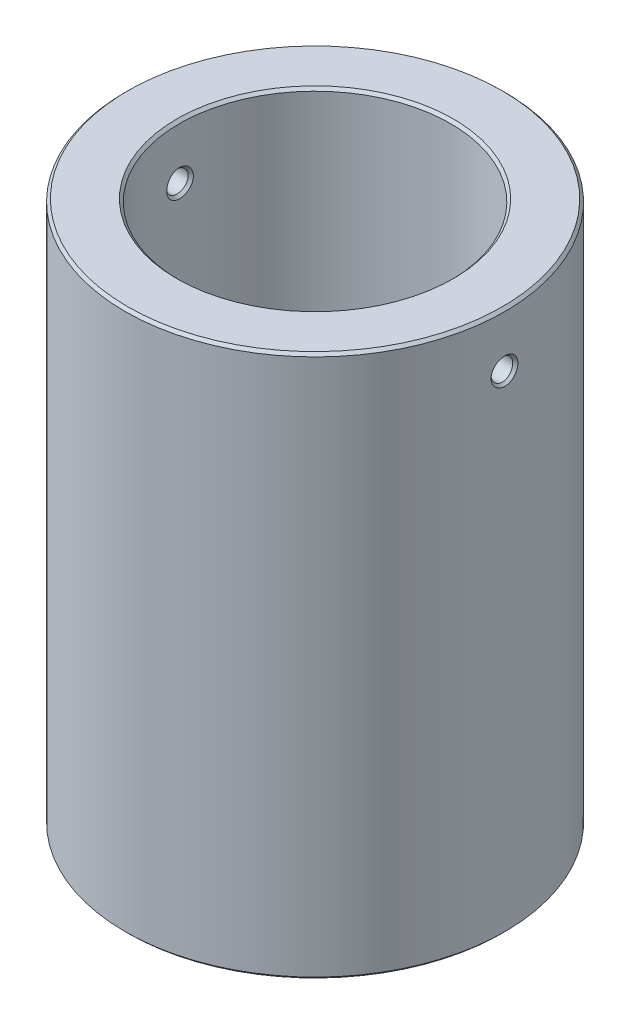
ISO-10303-21;
HEADER;
FILE_DESCRIPTION(('STEP AP214'),'2;1');
FILE_NAME('part.step','',(''),(''),'','','');
FILE_SCHEMA(('AUTOMOTIVE_DESIGN { 1 0 10303 214 1 1 1 1 }'));
ENDSEC;
DATA;
#1=APPLICATION_CONTEXT('core data for automotive mechanical design processes');
#2=APPLICATION_PROTOCOL_DEFINITION('international standard','automotive_design',2000,#1);
#3=PRODUCT_CONTEXT('',#1,'mechanical');
#4=PRODUCT('Part','Part','',(#3));
#5=PRODUCT_RELATED_PRODUCT_CATEGORY('part','',(#4));
#6=PRODUCT_DEFINITION_FORMATION('','',#4);
#7=PRODUCT_DEFINITION_CONTEXT('part definition',#1,'design');
#8=PRODUCT_DEFINITION('design','',#6,#7);
#9=PRODUCT_DEFINITION_SHAPE('','',#8);
#10=(LENGTH_UNIT() NAMED_UNIT(*) SI_UNIT(.MILLI.,.METRE.));
#11=(NAMED_UNIT(*) PLANE_ANGLE_UNIT() SI_UNIT($,.RADIAN.));
#12=(NAMED_UNIT(*) SI_UNIT($,.STERADIAN.) SOLID_ANGLE_UNIT());
#13=UNCERTAINTY_MEASURE_WITH_UNIT(LENGTH_MEASURE(1.E-05),#10,'distance_accuracy_value','');
#14=(GEOMETRIC_REPRESENTATION_CONTEXT(3) GLOBAL_UNCERTAINTY_ASSIGNED_CONTEXT((#13)) GLOBAL_UNIT_ASSIGNED_CONTEXT((#10,
#11,#12)) REPRESENTATION_CONTEXT('',''));
#15=CARTESIAN_POINT('',(0.,0.,0.));
#16=DIRECTION('',(0.,0.,1.));
#17=DIRECTION('',(1.,0.,0.));
#18=AXIS2_PLACEMENT_3D('',#15,#16,#17);
#19=CARTESIAN_POINT('',(0.,50.,0.));
#20=DIRECTION('',(0.,1.,0.));
#21=DIRECTION('',(0.,0.,1.));
#22=AXIS2_PLACEMENT_3D('',#19,#20,#21);
#23=PLANE('',#22);
#24=CARTESIAN_POINT('',(0.,50.,0.));
#25=DIRECTION('',(0.,1.,0.));
#26=DIRECTION('',(0.,0.,1.));
#27=AXIS2_PLACEMENT_3D('',#24,#25,#26);
#28=CIRCLE('',#27,25.5);
#29=CARTESIAN_POINT('',(0.,50.,25.5));
#30=VERTEX_POINT('',#29);
#31=EDGE_CURVE('E179',#30,#30,#28,.F.);
#32=ORIENTED_EDGE('',*,*,#31,.T.);
#33=EDGE_LOOP('',(#32));
#34=FACE_BOUND('',#33,.T.);
#35=CARTESIAN_POINT('',(0.,50.,0.));
#36=DIRECTION('',(0.,1.,0.));
#37=DIRECTION('',(0.,0.,1.));
#38=AXIS2_PLACEMENT_3D('',#35,#36,#37);
#39=CIRCLE('',#38,34.5);
#40=CARTESIAN_POINT('',(0.,50.,34.5));
#41=VERTEX_POINT('',#40);
#42=EDGE_CURVE('E183',#41,#41,#39,.T.);
#43=ORIENTED_EDGE('',*,*,#42,.T.);
#44=EDGE_LOOP('',(#43));
#45=FACE_BOUND('',#44,.T.);
#46=ADVANCED_FACE('F29',(#34,#45),#23,.T.);
#47=CARTESIAN_POINT('',(0.,-50.,0.));
#48=DIRECTION('',(0.,1.,0.));
#49=DIRECTION('',(0.,0.,1.));
#50=AXIS2_PLACEMENT_3D('',#47,#48,#49);
#51=PLANE('',#50);
#52=CARTESIAN_POINT('',(0.,-50.,0.));
#53=DIRECTION('',(0.,1.,0.));
#54=DIRECTION('',(0.,0.,1.));
#55=AXIS2_PLACEMENT_3D('',#52,#53,#54);
#56=CIRCLE('',#55,25.5);
#57=CARTESIAN_POINT('',(0.,-50.,25.5));
#58=VERTEX_POINT('',#57);
#59=EDGE_CURVE('E297',#58,#58,#56,.T.);
#60=ORIENTED_EDGE('',*,*,#59,.T.);
#61=EDGE_LOOP('',(#60));
#62=FACE_BOUND('',#61,.T.);
#63=CARTESIAN_POINT('',(0.,-50.,0.));
#64=DIRECTION('',(0.,1.,0.));
#65=DIRECTION('',(0.,0.,1.));
#66=AXIS2_PLACEMENT_3D('',#63,#64,#65);
#67=CIRCLE('',#66,34.5);
#68=CARTESIAN_POINT('',(0.,-50.,34.5));
#69=VERTEX_POINT('',#68);
#70=EDGE_CURVE('E295',#69,#69,#67,.F.);
#71=ORIENTED_EDGE('',*,*,#70,.T.);
#72=EDGE_LOOP('',(#71));
#73=FACE_BOUND('',#72,.T.);
#74=ADVANCED_FACE('F254',(#62,#73),#51,.F.);
#75=CARTESIAN_POINT('',(0.,50.,0.));
#76=DIRECTION('',(0.,-1.,0.));
#77=DIRECTION('',(0.,0.,-1.));
#78=AXIS2_PLACEMENT_3D('',#75,#76,#77);
#79=CYLINDRICAL_SURFACE('',#78,35.);
#80=CARTESIAN_POINT('',(0.,-49.5,0.));
#81=DIRECTION('',(0.,1.,0.));
#82=DIRECTION('',(0.,0.,1.));
#83=AXIS2_PLACEMENT_3D('',#80,#81,#82);
#84=CIRCLE('',#83,35.);
#85=CARTESIAN_POINT('',(0.,-49.5,35.));
#86=VERTEX_POINT('',#85);
#87=EDGE_CURVE('E10',#86,#86,#84,.T.);
#88=ORIENTED_EDGE('',*,*,#87,.T.);
#89=EDGE_LOOP('',(#88));
#90=FACE_BOUND('',#89,.T.);
#91=CARTESIAN_POINT('',(0.,49.5,0.));
#92=DIRECTION('',(0.,1.,0.));
#93=DIRECTION('',(0.,0.,1.));
#94=AXIS2_PLACEMENT_3D('',#91,#92,#93);
#95=CIRCLE('',#94,35.);
#96=CARTESIAN_POINT('',(0.,49.5,35.));
#97=VERTEX_POINT('',#96);
#98=EDGE_CURVE('E41',#97,#97,#95,.F.);
#99=ORIENTED_EDGE('',*,*,#98,.T.);
#100=EDGE_LOOP('',(#99));
#101=FACE_BOUND('',#100,.T.);
#102=CARTESIAN_POINT('',(34.9127404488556,40.,-2.46993002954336));
#103=CARTESIAN_POINT('',(34.9127390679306,40.0398870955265,-2.46995317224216));
#104=CARTESIAN_POINT('',(34.9128172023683,40.0797731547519,-2.46893868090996));
#105=CARTESIAN_POINT('',(34.9131240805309,40.1594100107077,-2.4648690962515));
#106=CARTESIAN_POINT('',(34.913352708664,40.199160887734,-2.46181556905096));
#107=CARTESIAN_POINT('',(34.9139520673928,40.278441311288,-2.45370398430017));
#108=CARTESIAN_POINT('',(34.9143227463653,40.3179709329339,-2.44864665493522));
#109=CARTESIAN_POINT('',(34.9151976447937,40.3967240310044,-2.43656425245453));
#110=CARTESIAN_POINT('',(34.9157018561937,40.4359475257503,-2.42953929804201));
#111=CARTESIAN_POINT('',(34.9168352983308,40.5140032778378,-2.41355794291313));
#112=CARTESIAN_POINT('',(34.917464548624,40.5528354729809,-2.40460124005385));
#113=CARTESIAN_POINT('',(34.9188395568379,40.6300236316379,-2.38479257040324));
#114=CARTESIAN_POINT('',(34.9195853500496,40.6683794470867,-2.37394002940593));
#115=CARTESIAN_POINT('',(34.921184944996,40.7445298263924,-2.35037570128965));
#116=CARTESIAN_POINT('',(34.9220387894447,40.7823241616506,-2.33766317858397));
#117=CARTESIAN_POINT('',(34.9238459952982,40.8572665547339,-2.3104148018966));
#118=CARTESIAN_POINT('',(34.9247994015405,40.8944143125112,-2.29587812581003));
#119=CARTESIAN_POINT('',(34.9267972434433,40.9679785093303,-2.26501728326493));
#120=CARTESIAN_POINT('',(34.9278417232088,41.0043945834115,-2.24869224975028));
#121=CARTESIAN_POINT('',(34.9300132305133,41.0764103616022,-2.21429049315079));
#122=CARTESIAN_POINT('',(34.9311403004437,41.1120096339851,-2.19621286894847));
#123=CARTESIAN_POINT('',(34.9334684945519,41.1823067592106,-2.15834172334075));
#124=CARTESIAN_POINT('',(34.9346696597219,41.217004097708,-2.13854724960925));
#125=CARTESIAN_POINT('',(34.9371375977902,41.2854123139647,-2.09727820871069));
#126=CARTESIAN_POINT('',(34.938404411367,41.3191225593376,-2.0758025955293));
#127=CARTESIAN_POINT('',(34.940995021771,41.3854716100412,-2.03120714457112));
#128=CARTESIAN_POINT('',(34.9423188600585,41.4181096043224,-2.00808610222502));
#129=CARTESIAN_POINT('',(34.9450155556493,41.4822291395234,-1.96023564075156));
#130=CARTESIAN_POINT('',(34.9463884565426,41.5137095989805,-1.93550477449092));
#131=CARTESIAN_POINT('',(34.949172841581,41.5754295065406,-1.88447091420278));
#132=CARTESIAN_POINT('',(34.9505843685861,41.6056674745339,-1.85816613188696));
#133=CARTESIAN_POINT('',(34.953444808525,41.6648166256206,-1.80401959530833));
#134=CARTESIAN_POINT('',(34.9548937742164,41.6937257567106,-1.77617560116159));
#135=CARTESIAN_POINT('',(34.9577917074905,41.7501047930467,-1.71902267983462));
#136=CARTESIAN_POINT('',(34.9592406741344,41.7775735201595,-1.68971259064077));
#137=CARTESIAN_POINT('',(34.962101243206,41.8310054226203,-1.6297461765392));
#138=CARTESIAN_POINT('',(34.9635128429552,41.8569684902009,-1.59908975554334));
#139=CARTESIAN_POINT('',(34.9662975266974,41.9073520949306,-1.53651626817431));
#140=CARTESIAN_POINT('',(34.9676705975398,41.93177210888,-1.50459878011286));
#141=CARTESIAN_POINT('',(34.9703678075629,41.9790338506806,-1.43958968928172));
#142=CARTESIAN_POINT('',(34.9716919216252,42.001874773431,-1.40649750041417));
#143=CARTESIAN_POINT('',(34.9742832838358,42.0459420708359,-1.33922508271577));
#144=CARTESIAN_POINT('',(34.975550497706,42.0671674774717,-1.30504421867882));
#145=CARTESIAN_POINT('',(34.9780194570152,42.1079674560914,-1.23568050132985));
#146=CARTESIAN_POINT('',(34.9792211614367,42.1275409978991,-1.20049704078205));
#147=CARTESIAN_POINT('',(34.9815506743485,42.1650008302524,-1.1292140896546));
#148=CARTESIAN_POINT('',(34.9826784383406,42.1828861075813,-1.09311406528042));
#149=CARTESIAN_POINT('',(34.9848515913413,42.2169329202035,-1.0200839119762));
#150=CARTESIAN_POINT('',(34.9858969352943,42.2330935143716,-0.983153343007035));
#151=CARTESIAN_POINT('',(34.9878967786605,42.2636544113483,-0.908548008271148));
#152=CARTESIAN_POINT('',(34.9888512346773,42.2780538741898,-0.870872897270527));
#153=CARTESIAN_POINT('',(34.9906608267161,42.3050559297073,-0.794864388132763));
#154=CARTESIAN_POINT('',(34.9915159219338,42.3176577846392,-0.756530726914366));
#155=CARTESIAN_POINT('',(34.9931183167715,42.3410280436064,-0.679291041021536));
#156=CARTESIAN_POINT('',(34.9938655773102,42.3517957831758,-0.640384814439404));
#157=CARTESIAN_POINT('',(34.9952438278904,42.37146126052,-0.562085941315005));
#158=CARTESIAN_POINT('',(34.9958747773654,42.3803583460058,-0.522693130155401));
#159=CARTESIAN_POINT('',(34.997011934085,42.3962460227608,-0.443507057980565));
#160=CARTESIAN_POINT('',(34.9975180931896,42.4032358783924,-0.403713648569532));
#161=CARTESIAN_POINT('',(34.9983972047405,42.4152727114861,-0.323812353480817));
#162=CARTESIAN_POINT('',(34.9987700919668,42.4203187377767,-0.283704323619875));
#163=CARTESIAN_POINT('',(34.9993742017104,42.4284316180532,-0.203259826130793));
#164=CARTESIAN_POINT('',(34.9996053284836,42.4314971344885,-0.162923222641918));
#165=CARTESIAN_POINT('',(34.9999174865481,42.4356130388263,-0.0821073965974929));
#166=CARTESIAN_POINT('',(34.9999983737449,42.4366614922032,-0.0416280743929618));
#167=CARTESIAN_POINT('',(35.0000015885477,42.4367068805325,0.039330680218));
#168=CARTESIAN_POINT('',(34.9999239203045,42.4357038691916,0.0798101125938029));
#169=CARTESIAN_POINT('',(34.9996180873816,42.4316776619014,0.160626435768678));
#170=CARTESIAN_POINT('',(34.9993900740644,42.4286564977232,0.200963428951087));
#171=CARTESIAN_POINT('',(34.9987920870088,42.4206314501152,0.281409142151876));
#172=CARTESIAN_POINT('',(34.9984222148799,42.4156289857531,0.3215180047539));
#173=CARTESIAN_POINT('',(34.9975490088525,42.4036783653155,0.40142155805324));
#174=CARTESIAN_POINT('',(34.9970457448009,42.3967312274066,0.441216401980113));
#175=CARTESIAN_POINT('',(34.9959142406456,42.3809281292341,0.520406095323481));
#176=CARTESIAN_POINT('',(34.9952860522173,42.372072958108,0.559801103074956));
#177=CARTESIAN_POINT('',(34.9939131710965,42.3524904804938,0.638105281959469));
#178=CARTESIAN_POINT('',(34.9931685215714,42.3417638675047,0.677014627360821));
#179=CARTESIAN_POINT('',(34.9915711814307,42.3184750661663,0.754261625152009));
#180=CARTESIAN_POINT('',(34.9907185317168,42.3059135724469,0.792599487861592));
#181=CARTESIAN_POINT('',(34.9889136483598,42.2789914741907,0.868617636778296));
#182=CARTESIAN_POINT('',(34.9879614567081,42.2646316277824,0.906298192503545));
#183=CARTESIAN_POINT('',(34.9859659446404,42.2341492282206,0.980915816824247));
#184=CARTESIAN_POINT('',(34.9849226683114,42.2180275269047,1.01785323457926));
#185=CARTESIAN_POINT('',(34.9827534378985,42.184057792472,1.09089864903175));
#186=CARTESIAN_POINT('',(34.981627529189,42.1662107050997,1.12700708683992));
#187=CARTESIAN_POINT('',(34.9793014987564,42.1288265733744,1.19830859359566));
#188=CARTESIAN_POINT('',(34.9781014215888,42.1092905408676,1.23350219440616));
#189=CARTESIAN_POINT('',(34.9756354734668,42.0685649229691,1.30288808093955));
#190=CARTESIAN_POINT('',(34.9743696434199,42.0473763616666,1.33708096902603));
#191=CARTESIAN_POINT('',(34.9717807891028,42.0033821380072,1.40437950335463));
#192=CARTESIAN_POINT('',(34.9704577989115,41.9805774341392,1.43748577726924));
#193=CARTESIAN_POINT('',(34.9677625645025,41.9333874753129,1.50252521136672));
#194=CARTESIAN_POINT('',(34.9663903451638,41.9090030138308,1.53445894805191));
#195=CARTESIAN_POINT('',(34.9636070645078,41.8586901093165,1.59706748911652));
#196=CARTESIAN_POINT('',(34.9621960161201,41.8327621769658,1.62774270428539));
#197=CARTESIAN_POINT('',(34.9593362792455,41.7793993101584,1.68774860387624));
#198=CARTESIAN_POINT('',(34.9578875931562,41.751964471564,1.71707937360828));
#199=CARTESIAN_POINT('',(34.9549898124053,41.6956560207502,1.77427785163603));
#200=CARTESIAN_POINT('',(34.9535407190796,41.6667836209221,1.80214675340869));
#201=CARTESIAN_POINT('',(34.9506795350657,41.6077130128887,1.85634876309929));
#202=CARTESIAN_POINT('',(34.9492673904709,41.5775169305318,1.88268418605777));
#203=CARTESIAN_POINT('',(34.9464813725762,41.5158834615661,1.93378347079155));
#204=CARTESIAN_POINT('',(34.9451074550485,41.484447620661,1.95854919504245));
#205=CARTESIAN_POINT('',(34.942408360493,41.4204186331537,2.00647308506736));
#206=CARTESIAN_POINT('',(34.9410831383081,41.3878266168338,2.02963275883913));
#207=CARTESIAN_POINT('',(34.9384894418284,41.3215692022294,2.07430847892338));
#208=CARTESIAN_POINT('',(34.9372209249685,41.2879046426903,2.09582576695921));
#209=CARTESIAN_POINT('',(34.9347493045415,41.2195859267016,2.13718054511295));
#210=CARTESIAN_POINT('',(34.9335461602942,41.1849324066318,2.15701908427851));
#211=CARTESIAN_POINT('',(34.9312137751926,41.1147194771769,2.19498011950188));
#212=CARTESIAN_POINT('',(34.9300844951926,41.079160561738,2.2131035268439));
#213=CARTESIAN_POINT('',(34.9279083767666,41.0072204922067,2.24759799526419));
#214=CARTESIAN_POINT('',(34.9268615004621,40.9708397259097,2.2639698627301));
#215=CARTESIAN_POINT('',(34.9248587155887,40.8973395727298,2.29492491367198));
#216=CARTESIAN_POINT('',(34.9239027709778,40.8602204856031,2.30950880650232));
#217=CARTESIAN_POINT('',(34.9220903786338,40.7853272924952,2.33685156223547));
#218=CARTESIAN_POINT('',(34.9212338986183,40.7475534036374,2.34961101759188));
#219=CARTESIAN_POINT('',(34.9196289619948,40.6714342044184,2.37326856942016));
#220=CARTESIAN_POINT('',(34.9188804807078,40.6330890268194,2.38416709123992));
#221=CARTESIAN_POINT('',(34.9175000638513,40.55591084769,2.40406650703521));
#222=CARTESIAN_POINT('',(34.9168681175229,40.5170778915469,2.41306757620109));
#223=CARTESIAN_POINT('',(34.9157292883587,40.4390077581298,2.42913586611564));
#224=CARTESIAN_POINT('',(34.9152224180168,40.3997705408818,2.43620289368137));
#225=CARTESIAN_POINT('',(34.9143422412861,40.320975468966,2.44836713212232));
#226=CARTESIAN_POINT('',(34.9139689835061,40.2814175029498,2.45346362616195));
#227=CARTESIAN_POINT('',(34.9133645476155,40.2020645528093,2.46165049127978));
#228=CARTESIAN_POINT('',(34.9131334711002,40.162269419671,2.46473942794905));
#229=CARTESIAN_POINT('',(34.9128217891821,40.0825255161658,2.46887691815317));
#230=CARTESIAN_POINT('',(34.9127413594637,40.0425766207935,2.469923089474));
#231=CARTESIAN_POINT('',(34.9127397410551,39.9626599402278,2.46993410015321));
#232=CARTESIAN_POINT('',(34.9128186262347,39.9226921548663,2.4688979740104));
#233=CARTESIAN_POINT('',(34.9131276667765,39.8428761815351,2.46477276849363));
#234=CARTESIAN_POINT('',(34.9133577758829,39.8030279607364,2.46168431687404));
#235=CARTESIAN_POINT('',(34.9139605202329,39.7235392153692,2.45349467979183));
#236=CARTESIAN_POINT('',(34.9143331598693,39.6838986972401,2.44839343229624));
#237=CARTESIAN_POINT('',(34.915212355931,39.6049136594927,2.43621625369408));
#238=CARTESIAN_POINT('',(34.9157189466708,39.5655692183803,2.42913981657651));
#239=CARTESIAN_POINT('',(34.9168574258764,39.4872645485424,2.41305057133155));
#240=CARTESIAN_POINT('',(34.917489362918,39.4483044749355,2.40403701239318));
#241=CARTESIAN_POINT('',(34.9188699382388,39.3708567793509,2.38411150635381));
#242=CARTESIAN_POINT('',(34.9196186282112,39.3323693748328,2.37319871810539));
#243=CARTESIAN_POINT('',(34.9212241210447,39.2559552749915,2.34951262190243));
#244=CARTESIAN_POINT('',(34.9220809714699,39.2180288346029,2.33673849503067));
#245=CARTESIAN_POINT('',(34.9238942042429,39.1428249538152,2.30936747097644));
#246=CARTESIAN_POINT('',(34.9248506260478,39.105547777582,2.29476985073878));
#247=CARTESIAN_POINT('',(34.9268544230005,39.0317307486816,2.26378952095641));
#248=CARTESIAN_POINT('',(34.9279018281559,38.9951911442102,2.24740622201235));
#249=CARTESIAN_POINT('',(34.9300790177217,38.9229376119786,2.21289217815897));
#250=CARTESIAN_POINT('',(34.9312088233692,38.8872239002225,2.19476098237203));
#251=CARTESIAN_POINT('',(34.9335422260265,38.8167105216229,2.15678878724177));
#252=CARTESIAN_POINT('',(34.9347458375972,38.7819110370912,2.13694745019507));
#253=CARTESIAN_POINT('',(34.9372183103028,38.7133144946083,2.09559262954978));
#254=CARTESIAN_POINT('',(34.9384871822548,38.6795176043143,2.07407886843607));
#255=CARTESIAN_POINT('',(34.941081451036,38.6130145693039,2.02941694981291));
#256=CARTESIAN_POINT('',(34.9424068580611,38.5803086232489,2.00626849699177));
#257=CARTESIAN_POINT('',(34.9451061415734,38.5160759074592,1.95837487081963));
#258=CARTESIAN_POINT('',(34.9464800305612,38.484549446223,1.93362928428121));
#259=CARTESIAN_POINT('',(34.9492657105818,38.422763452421,1.88257973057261));
#260=CARTESIAN_POINT('',(34.9506775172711,38.3925044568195,1.8562751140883));
#261=CARTESIAN_POINT('',(34.9535378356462,38.3333432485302,1.80214384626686));
#262=CARTESIAN_POINT('',(34.9549863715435,38.3044419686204,1.77431617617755));
#263=CARTESIAN_POINT('',(34.9578829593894,38.2480966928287,1.71720255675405));
#264=CARTESIAN_POINT('',(34.9593310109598,38.2206532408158,1.68791607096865));
#265=CARTESIAN_POINT('',(34.9621895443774,38.167273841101,1.62799556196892));
#266=CARTESIAN_POINT('',(34.9636000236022,38.1413379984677,1.59736144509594));
#267=CARTESIAN_POINT('',(34.9663823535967,38.0910113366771,1.53483095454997));
#268=CARTESIAN_POINT('',(34.9677541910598,38.0666210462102,1.50293415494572));
#269=CARTESIAN_POINT('',(34.9704487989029,38.0194208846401,1.43796540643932));
#270=CARTESIAN_POINT('',(34.9717715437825,37.9966118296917,1.40489286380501));
#271=CARTESIAN_POINT('',(34.9743600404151,37.9526102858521,1.33765903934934));
#272=CARTESIAN_POINT('',(34.9756257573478,37.931418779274,1.30349711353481));
#273=CARTESIAN_POINT('',(34.9780915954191,37.8906884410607,1.23417097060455));
#274=CARTESIAN_POINT('',(34.979291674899,37.8711506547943,1.19900613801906));
#275=CARTESIAN_POINT('',(34.9816178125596,37.8337640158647,1.12776051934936));
#276=CARTESIAN_POINT('',(34.9827438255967,37.8159161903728,1.09167919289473));
#277=CARTESIAN_POINT('',(34.98491335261,37.7819458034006,1.01868689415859));
#278=CARTESIAN_POINT('',(34.9859568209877,37.7658241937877,0.981775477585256));
#279=CARTESIAN_POINT('',(34.9879527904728,37.7353426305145,0.907209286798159));
#280=CARTESIAN_POINT('',(34.9889052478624,37.7209835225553,0.869554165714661));
#281=CARTESIAN_POINT('',(34.9907107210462,37.6940633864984,0.793586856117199));
#282=CARTESIAN_POINT('',(34.9915636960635,37.6815030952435,0.755274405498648));
#283=CARTESIAN_POINT('',(34.9931617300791,37.6582170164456,0.678078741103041));
#284=CARTESIAN_POINT('',(34.9939067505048,37.6474918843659,0.639195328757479));
#285=CARTESIAN_POINT('',(34.9952804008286,37.6279125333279,0.560944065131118));
#286=CARTESIAN_POINT('',(34.9959089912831,37.6190589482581,0.521576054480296));
#287=CARTESIAN_POINT('',(34.9970413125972,37.6032589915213,0.442441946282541));
#288=CARTESIAN_POINT('',(34.997544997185,37.5963133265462,0.402675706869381));
#289=CARTESIAN_POINT('',(34.9984190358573,37.5843655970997,0.322831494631));
#290=CARTESIAN_POINT('',(34.9987893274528,37.5793644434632,0.282753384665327));
#291=CARTESIAN_POINT('',(34.9993881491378,37.5713413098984,0.202371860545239));
#292=CARTESIAN_POINT('',(34.9996165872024,37.5683206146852,0.162068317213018));
#293=CARTESIAN_POINT('',(34.9999231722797,37.5642963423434,0.0813220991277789));
#294=CARTESIAN_POINT('',(35.0000011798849,37.5632946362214,0.0408793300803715));
#295=CARTESIAN_POINT('',(34.9999988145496,37.5633365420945,-0.0400085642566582));
#296=CARTESIAN_POINT('',(34.9999184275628,37.5643803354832,-0.0804536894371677));
#297=CARTESIAN_POINT('',(34.9996077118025,37.5684749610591,-0.161209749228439));
#298=CARTESIAN_POINT('',(34.9993774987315,37.5715242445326,-0.201520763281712));
#299=CARTESIAN_POINT('',(34.9987755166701,37.5795963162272,-0.281922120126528));
#300=CARTESIAN_POINT('',(34.9984038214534,37.5846180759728,-0.322012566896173));
#301=CARTESIAN_POINT('',(34.9975273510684,37.5965992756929,-0.401886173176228));
#302=CARTESIAN_POINT('',(34.9970226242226,37.6035580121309,-0.441669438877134));
#303=CARTESIAN_POINT('',(34.9958885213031,37.6193782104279,-0.520842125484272));
#304=CARTESIAN_POINT('',(34.9952591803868,37.6282391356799,-0.560231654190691));
#305=CARTESIAN_POINT('',(34.9938842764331,37.6478287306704,-0.638530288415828));
#306=CARTESIAN_POINT('',(34.9931387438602,37.6585569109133,-0.67743951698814));
#307=CARTESIAN_POINT('',(34.9915398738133,37.6818462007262,-0.754690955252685));
#308=CARTESIAN_POINT('',(34.990686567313,37.6944067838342,-0.79303332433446));
#309=CARTESIAN_POINT('',(34.9888805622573,37.72132613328,-0.869064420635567));
#310=CARTESIAN_POINT('',(34.9879278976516,37.7356842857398,-0.906753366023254));
#311=CARTESIAN_POINT('',(34.9859315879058,37.7661640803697,-0.981390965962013));
#312=CARTESIAN_POINT('',(34.9848879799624,37.782285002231,-1.01833991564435));
#313=CARTESIAN_POINT('',(34.9827181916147,37.8162556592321,-1.0914108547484));
#314=CARTESIAN_POINT('',(34.9815920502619,37.8341045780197,-1.12753322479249));
#315=CARTESIAN_POINT('',(34.9792656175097,37.8714965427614,-1.19886432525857));
#316=CARTESIAN_POINT('',(34.9780653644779,37.8910387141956,-1.23407351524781));
#317=CARTESIAN_POINT('',(34.9755990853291,37.9317824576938,-1.30349158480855));
#318=CARTESIAN_POINT('',(34.9743330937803,37.9529831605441,-1.33770097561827));
#319=CARTESIAN_POINT('',(34.9717438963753,37.9970091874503,-1.40503279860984));
#320=CARTESIAN_POINT('',(34.9704207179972,38.0198337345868,-1.43815573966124));
#321=CARTESIAN_POINT('',(34.9677250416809,38.0670725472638,-1.50322809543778));
#322=CARTESIAN_POINT('',(34.9663525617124,38.0914862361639,-1.53517792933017));
#323=CARTESIAN_POINT('',(34.9635686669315,38.1418684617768,-1.59781750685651));
#324=CARTESIAN_POINT('',(34.9621572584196,38.1678367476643,-1.62850745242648));
#325=CARTESIAN_POINT('',(34.959296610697,38.2212926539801,-1.68854115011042));
#326=CARTESIAN_POINT('',(34.9578473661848,38.2487804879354,-1.71788471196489));
#327=CARTESIAN_POINT('',(34.9549486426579,38.3052057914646,-1.7751020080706));
#328=CARTESIAN_POINT('',(34.953499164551,38.3341422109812,-1.80297677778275));
#329=CARTESIAN_POINT('',(34.9506377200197,38.393347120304,-1.85718062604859));
#330=CARTESIAN_POINT('',(34.9492256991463,38.4236134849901,-1.88351202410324));
#331=CARTESIAN_POINT('',(34.9464403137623,38.4853915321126,-1.93459500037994));
#332=CARTESIAN_POINT('',(34.9450669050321,38.5169016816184,-1.95934843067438));
#333=CARTESIAN_POINT('',(34.9423691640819,38.581081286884,-2.00724086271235));
#334=CARTESIAN_POINT('',(34.9410447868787,38.6137496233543,-2.03038136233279));
#335=CARTESIAN_POINT('',(34.9384530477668,38.6801596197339,-2.07501330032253));
#336=CARTESIAN_POINT('',(34.9371856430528,38.7139004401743,-2.09650598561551));
#337=CARTESIAN_POINT('',(34.9347164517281,38.7823695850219,-2.13780752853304));
#338=CARTESIAN_POINT('',(34.9335146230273,38.8170972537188,-2.15761747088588));
#339=CARTESIAN_POINT('',(34.9311850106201,38.887454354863,-2.19551867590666));
#340=CARTESIAN_POINT('',(34.9300571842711,38.9230832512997,-2.21361093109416));
#341=CARTESIAN_POINT('',(34.9278840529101,38.9951571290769,-2.24804183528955));
#342=CARTESIAN_POINT('',(34.9268387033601,39.0316016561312,-2.26438143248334));
#343=CARTESIAN_POINT('',(34.9248389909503,39.1052211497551,-2.29527204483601));
#344=CARTESIAN_POINT('',(34.9238845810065,39.1423957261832,-2.30982398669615));
#345=CARTESIAN_POINT('',(34.9220752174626,39.2173896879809,-2.33710428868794));
#346=CARTESIAN_POINT('',(34.921220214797,39.2552087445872,-2.3498335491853));
#347=CARTESIAN_POINT('',(34.9196181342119,39.3314060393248,-2.37343349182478));
#348=CARTESIAN_POINT('',(34.9188710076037,39.3697840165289,-2.38430501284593));
#349=CARTESIAN_POINT('',(34.9174931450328,39.4470135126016,-2.40415451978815));
#350=CARTESIAN_POINT('',(34.9168623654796,39.4858648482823,-2.41313321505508));
#351=CARTESIAN_POINT('',(34.9157256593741,39.5639554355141,-2.42916216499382));
#352=CARTESIAN_POINT('',(34.9152197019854,39.6031945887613,-2.43621289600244));
#353=CARTESIAN_POINT('',(34.9143410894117,39.6819750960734,-2.44835118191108));
#354=CARTESIAN_POINT('',(34.9139684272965,39.7215164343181,-2.45343883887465));
#355=CARTESIAN_POINT('',(34.9133648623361,39.8008159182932,-2.46161614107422));
#356=CARTESIAN_POINT('',(34.91313399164,39.840574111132,-2.46470533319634));
#357=CARTESIAN_POINT('',(34.9128223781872,39.9202207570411,-2.46885196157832));
#358=CARTESIAN_POINT('',(34.9127417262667,39.9601092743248,-2.46990816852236));
#359=CARTESIAN_POINT('',(34.9127404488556,40.,-2.46993002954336));
#360=B_SPLINE_CURVE_WITH_KNOTS('',3,(#102,#103,#104,#105,#106,#107,#108,#109,#110,#111,#112,
#113,#114,#115,#116,#117,#118,#119,#120,#121,#122,#123,#124,#125,#126,#127,#128,#129,#130,#131,
#132,#133,#134,#135,#136,#137,#138,#139,#140,#141,#142,#143,#144,#145,#146,#147,#148,#149,#150,
#151,#152,#153,#154,#155,#156,#157,#158,#159,#160,#161,#162,#163,#164,#165,#166,#167,#168,#169,
#170,#171,#172,#173,#174,#175,#176,#177,#178,#179,#180,#181,#182,#183,#184,#185,#186,#187,#188,
#189,#190,#191,#192,#193,#194,#195,#196,#197,#198,#199,#200,#201,#202,#203,#204,#205,#206,#207,
#208,#209,#210,#211,#212,#213,#214,#215,#216,#217,#218,#219,#220,#221,#222,#223,#224,#225,#226,
#227,#228,#229,#230,#231,#232,#233,#234,#235,#236,#237,#238,#239,#240,#241,#242,#243,#244,#245,
#246,#247,#248,#249,#250,#251,#252,#253,#254,#255,#256,#257,#258,#259,#260,#261,#262,#263,#264,
#265,#266,#267,#268,#269,#270,#271,#272,#273,#274,#275,#276,#277,#278,#279,#280,#281,#282,#283,
#284,#285,#286,#287,#288,#289,#290,#291,#292,#293,#294,#295,#296,#297,#298,#299,#300,#301,#302,
#303,#304,#305,#306,#307,#308,#309,#310,#311,#312,#313,#314,#315,#316,#317,#318,#319,#320,#321,
#322,#323,#324,#325,#326,#327,#328,#329,#330,#331,#332,#333,#334,#335,#336,#337,#338,#339,#340,
#341,#342,#343,#344,#345,#346,#347,#348,#349,#350,#351,#352,#353,#354,#355,#356,#357,#358,#359),
.UNSPECIFIED.,.F.,.F.,(4,2,2,2,2,2,2,2,2,2,2,2,2,2,2,2,2,2,2,2,2,2,2,2,2,2,2,2,2,2,2,2,2,2,2,2,
2,2,2,2,2,2,2,2,2,2,2,2,2,2,2,2,2,2,2,2,2,2,2,2,2,2,2,2,2,2,2,2,2,2,2,2,2,2,2,2,2,2,2,2,2,2,2,2,
2,2,2,2,2,2,2,2,2,2,2,2,2,2,2,2,2,2,2,2,2,2,2,2,2,2,2,2,2,2,2,2,2,2,2,2,2,2,2,2,2,2,2,2,4),(0.,
0.11964537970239,0.239198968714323,0.358709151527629,0.478212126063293,0.59773380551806,
0.717291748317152,0.836897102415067,0.956556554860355,1.0762742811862,1.19605389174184,
1.3159003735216,1.43582202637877,1.55583239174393,1.67595217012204,1.79621112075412,
1.91664993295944,2.03718576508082,2.15773021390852,2.27831531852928,2.39896145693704,
2.51967932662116,2.64047193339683,2.76133657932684,2.88226684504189,3.00325456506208,
3.12429179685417,3.24537278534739,3.36649592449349,3.48766571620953,3.60889472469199,
3.7302055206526,3.85163260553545,3.97305651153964,4.0943583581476,4.2155734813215,
4.336725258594,4.45782702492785,4.57888400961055,4.6998952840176,4.82085571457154,
4.94175791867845,5.06259422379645,5.18335863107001,5.3040487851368,5.42466795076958,
5.54522699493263,5.66574636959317,5.78625808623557,5.9066698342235,6.02689481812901,
6.14697437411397,6.26693961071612,6.38681323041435,6.5066113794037,6.62634551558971,
6.74602428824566,6.86565542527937,6.98524762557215,7.10481245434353,7.22436623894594,
7.34393196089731,7.46354113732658,7.58323568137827,7.70306972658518,7.8229593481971,
7.94281231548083,8.06266897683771,8.18255637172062,8.30249031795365,8.4224775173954,
8.54251766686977,8.6626055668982,8.78273322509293,8.90289195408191,9.02307446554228,
9.14327696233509,9.26350122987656,9.38375672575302,9.50406266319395,9.62445007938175,
9.74488209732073,9.86532249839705,9.98580387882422,10.1063469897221,10.2269627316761,
10.3476541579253,10.4684184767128,10.5892490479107,10.7101373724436,10.8310750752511,
10.9520558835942,11.0730776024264,11.1941440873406,11.3152672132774,11.4364688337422,
11.5577827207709,11.6791073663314,11.800338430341,11.9215063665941,12.0426303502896,
12.1637202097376,12.2847783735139,12.4058018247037,12.5267840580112,12.6477170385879,
12.7685931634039,12.8894072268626,13.0101583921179,13.1308521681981,13.2515023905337,
13.3721331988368,13.4927810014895,13.6133425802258,13.7337180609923,13.8539495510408,
13.9740678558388,14.0940943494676,14.2140428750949,14.333921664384,14.4537352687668,
14.5734864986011,14.6931783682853,14.8128160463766,14.9324088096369,15.0519719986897,
15.1715289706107,15.291113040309,15.4107693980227),.UNSPECIFIED.);
#361=CARTESIAN_POINT('',(34.9127404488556,40.,-2.46993002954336));
#362=VERTEX_POINT('',#361);
#363=EDGE_CURVE('E46',#362,#362,#360,.F.);
#364=ORIENTED_EDGE('',*,*,#363,.T.);
#365=EDGE_LOOP('',(#364));
#366=FACE_BOUND('',#365,.T.);
#367=CARTESIAN_POINT('',(-35.,37.5633155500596,0.));
#368=CARTESIAN_POINT('',(-35.0000012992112,37.5632940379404,0.0404291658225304));
#369=CARTESIAN_POINT('',(-34.999923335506,37.5642955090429,0.0808573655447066));
#370=CARTESIAN_POINT('',(-34.9996171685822,37.568311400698,0.161576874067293));
#371=CARTESIAN_POINT('',(-34.9993891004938,37.5713240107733,0.201868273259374));
#372=CARTESIAN_POINT('',(-34.9987911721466,37.5793267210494,0.282226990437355));
#373=CARTESIAN_POINT('',(-34.9984214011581,37.5843155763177,0.322294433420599));
#374=CARTESIAN_POINT('',(-34.9975485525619,37.5962348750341,0.402119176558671));
#375=CARTESIAN_POINT('',(-34.9970455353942,37.6031644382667,0.441876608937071));
#376=CARTESIAN_POINT('',(-34.9959146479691,37.6189296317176,0.520994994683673));
#377=CARTESIAN_POINT('',(-34.9952868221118,37.6277645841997,0.560356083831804));
#378=CARTESIAN_POINT('',(-34.9939147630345,37.6473051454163,0.638595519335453));
#379=CARTESIAN_POINT('',(-34.9931705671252,37.6580101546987,0.67747401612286));
#380=CARTESIAN_POINT('',(-34.9915742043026,37.6812555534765,0.754661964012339));
#381=CARTESIAN_POINT('',(-34.9907220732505,37.6937953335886,0.792971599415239));
#382=CARTESIAN_POINT('',(-34.9889182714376,37.720675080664,0.868935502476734));
#383=CARTESIAN_POINT('',(-34.9879666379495,37.7350143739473,0.90659000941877));
#384=CARTESIAN_POINT('',(-34.9859722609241,37.7654580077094,0.981157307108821));
#385=CARTESIAN_POINT('',(-34.9849295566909,37.7815615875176,1.01807040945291));
#386=CARTESIAN_POINT('',(-34.9827614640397,37.8154986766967,1.09106852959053));
#387=CARTESIAN_POINT('',(-34.9816361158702,37.8333313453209,1.12715393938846));
#388=CARTESIAN_POINT('',(-34.9793111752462,37.8706914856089,1.19841029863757));
#389=CARTESIAN_POINT('',(-34.978111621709,37.8902180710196,1.23358171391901));
#390=CARTESIAN_POINT('',(-34.9756466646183,37.9309308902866,1.30292370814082));
#391=CARTESIAN_POINT('',(-34.9743812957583,37.9521162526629,1.33709479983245));
#392=CARTESIAN_POINT('',(-34.9717932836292,37.9961113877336,1.40434982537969));
#393=CARTESIAN_POINT('',(-34.9704706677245,38.0189203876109,1.43743426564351));
#394=CARTESIAN_POINT('',(-34.9677760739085,38.0661275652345,1.50242962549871));
#395=CARTESIAN_POINT('',(-34.9664041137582,38.0905251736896,1.53434095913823));
#396=CARTESIAN_POINT('',(-34.9636212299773,38.1408739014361,1.59690419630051));
#397=CARTESIAN_POINT('',(-34.9622103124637,38.1668247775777,1.62755629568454));
#398=CARTESIAN_POINT('',(-34.9593506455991,38.2202454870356,1.68751393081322));
#399=CARTESIAN_POINT('',(-34.9579018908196,38.2477155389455,1.71681927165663));
#400=CARTESIAN_POINT('',(-34.9550039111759,38.3041034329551,1.77396919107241));
#401=CARTESIAN_POINT('',(-34.9535546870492,38.333020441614,1.80181459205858));
#402=CARTESIAN_POINT('',(-34.9506932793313,38.3921845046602,1.85597697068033));
#403=CARTESIAN_POINT('',(-34.9492810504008,38.4224297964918,1.88229587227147));
#404=CARTESIAN_POINT('',(-34.9464948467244,38.4841658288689,1.93336778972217));
#405=CARTESIAN_POINT('',(-34.9451208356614,38.5156553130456,1.95812232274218));
#406=CARTESIAN_POINT('',(-34.9424215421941,38.5797941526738,2.00602929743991));
#407=CARTESIAN_POINT('',(-34.9410962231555,38.6124425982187,2.0291829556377));
#408=CARTESIAN_POINT('',(-34.938502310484,38.6788142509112,2.07385149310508));
#409=CARTESIAN_POINT('',(-34.9372336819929,38.7125367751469,2.09536738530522));
#410=CARTESIAN_POINT('',(-34.9347618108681,38.7809715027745,2.13672370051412));
#411=CARTESIAN_POINT('',(-34.9335585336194,38.8156831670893,2.15656501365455));
#412=CARTESIAN_POINT('',(-34.931225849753,38.8860111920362,2.19453536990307));
#413=CARTESIAN_POINT('',(-34.9300964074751,38.9216271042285,2.21266524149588));
#414=CARTESIAN_POINT('',(-34.9279199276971,38.9936786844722,2.24717585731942));
#415=CARTESIAN_POINT('',(-34.9268728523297,39.0301139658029,2.26355740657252));
#416=CARTESIAN_POINT('',(-34.9248696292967,39.1037193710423,2.29453447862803));
#417=CARTESIAN_POINT('',(-34.9239134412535,39.1408891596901,2.30913079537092));
#418=CARTESIAN_POINT('',(-34.9221005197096,39.215878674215,2.33650049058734));
#419=CARTESIAN_POINT('',(-34.921243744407,39.2536981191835,2.34927463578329));
#420=CARTESIAN_POINT('',(-34.9196381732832,39.3299020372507,2.37296309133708));
#421=CARTESIAN_POINT('',(-34.9188893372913,39.3682862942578,2.383878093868));
#422=CARTESIAN_POINT('',(-34.9175081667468,39.4455349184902,2.40381141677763));
#423=CARTESIAN_POINT('',(-34.916875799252,39.4843991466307,2.41283027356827));
#424=CARTESIAN_POINT('',(-34.9157360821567,39.5625227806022,2.42893453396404));
#425=CARTESIAN_POINT('',(-34.9152287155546,39.6017821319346,2.43602020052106));
#426=CARTESIAN_POINT('',(-34.9143475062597,39.6806110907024,2.44822145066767));
#427=CARTESIAN_POINT('',(-34.9139736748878,39.7201807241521,2.45333686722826));
#428=CARTESIAN_POINT('',(-34.9133680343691,39.799545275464,2.46156106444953));
#429=CARTESIAN_POINT('',(-34.9131362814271,39.8393402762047,2.464669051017));
#430=CARTESIAN_POINT('',(-34.9128232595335,39.9190708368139,2.46884234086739));
#431=CARTESIAN_POINT('',(-34.9127421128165,39.9590064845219,2.46990598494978));
#432=CARTESIAN_POINT('',(-34.9127388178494,40.0388776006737,2.46995360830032));
#433=CARTESIAN_POINT('',(-34.912816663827,40.0788130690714,2.46893766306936));
#434=CARTESIAN_POINT('',(-34.9131232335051,40.1585429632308,2.46485777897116));
#435=CARTESIAN_POINT('',(-34.9133518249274,40.1983374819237,2.46179563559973));
#436=CARTESIAN_POINT('',(-34.9139512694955,40.2777009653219,2.45366175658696));
#437=CARTESIAN_POINT('',(-34.9143220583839,40.3172700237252,2.4485909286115));
#438=CARTESIAN_POINT('',(-34.9151973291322,40.3960979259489,2.43647747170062));
#439=CARTESIAN_POINT('',(-34.915701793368,40.4353568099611,2.42943510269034));
#440=CARTESIAN_POINT('',(-34.9168358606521,40.5134798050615,2.41341620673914));
#441=CARTESIAN_POINT('',(-34.9174654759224,40.5523438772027,2.40443949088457));
#442=CARTESIAN_POINT('',(-34.9188413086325,40.6295926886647,2.38458932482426));
#443=CARTESIAN_POINT('',(-34.9195875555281,40.6679773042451,2.37371539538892));
#444=CARTESIAN_POINT('',(-34.9211881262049,40.7441826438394,2.35010807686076));
#445=CARTESIAN_POINT('',(-34.9220424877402,40.7820031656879,2.33737403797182));
#446=CARTESIAN_POINT('',(-34.9238507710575,40.856995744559,2.31008365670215));
#447=CARTESIAN_POINT('',(-34.924804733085,40.8941675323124,2.29552657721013));
#448=CARTESIAN_POINT('',(-34.9268037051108,40.9677780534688,2.26462719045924));
#449=CARTESIAN_POINT('',(-34.9278487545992,41.0042164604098,2.24828410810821));
#450=CARTESIAN_POINT('',(-34.9300213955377,41.0762756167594,2.21384974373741));
#451=CARTESIAN_POINT('',(-34.9311490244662,41.1118959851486,2.19575766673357));
#452=CARTESIAN_POINT('',(-34.933478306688,41.1822344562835,2.15786232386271));
#453=CARTESIAN_POINT('',(-34.934679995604,41.216952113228,2.13805823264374));
#454=CARTESIAN_POINT('',(-34.937148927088,41.2854005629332,2.0967758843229));
#455=CARTESIAN_POINT('',(-34.9384162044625,41.3191308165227,2.07529673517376));
#456=CARTESIAN_POINT('',(-34.9410076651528,41.3855198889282,2.03070132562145));
#457=CARTESIAN_POINT('',(-34.9423318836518,41.41817802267,2.00758404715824));
#458=CARTESIAN_POINT('',(-34.9450292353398,41.4823383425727,1.95974950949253));
#459=CARTESIAN_POINT('',(-34.9464024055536,41.5138396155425,1.93503102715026));
#460=CARTESIAN_POINT('',(-34.9491872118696,41.5756017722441,1.88403122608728));
#461=CARTESIAN_POINT('',(-34.9505988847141,41.6058613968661,1.85774838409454));
#462=CARTESIAN_POINT('',(-34.9534594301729,41.6650559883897,1.80365734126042));
#463=CARTESIAN_POINT('',(-34.954908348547,41.6939891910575,1.77584721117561));
#464=CARTESIAN_POINT('',(-34.9578061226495,41.7504142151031,1.71877107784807));
#465=CARTESIAN_POINT('',(-34.9592549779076,41.7779052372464,1.68950428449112));
#466=CARTESIAN_POINT('',(-34.9621153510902,41.8313745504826,1.6296290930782));
#467=CARTESIAN_POINT('',(-34.9635268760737,41.8573531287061,1.59902095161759));
#468=CARTESIAN_POINT('',(-34.9663113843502,41.9077622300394,1.53654842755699));
#469=CARTESIAN_POINT('',(-34.9676843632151,41.9321925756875,1.5046839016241));
#470=CARTESIAN_POINT('',(-34.9703813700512,41.9794696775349,1.43978351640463));
#471=CARTESIAN_POINT('',(-34.9717053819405,42.0023159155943,1.40674727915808));
#472=CARTESIAN_POINT('',(-34.9742965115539,42.0463891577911,1.33958829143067));
#473=CARTESIAN_POINT('',(-34.9755636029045,42.0676154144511,1.30546504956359));
#474=CARTESIAN_POINT('',(-34.9780322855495,42.1084129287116,1.23621674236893));
#475=CARTESIAN_POINT('',(-34.9792338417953,42.1279833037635,1.20109115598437));
#476=CARTESIAN_POINT('',(-34.9815630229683,42.1654331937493,1.12992277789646));
#477=CARTESIAN_POINT('',(-34.982690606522,42.1833117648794,1.0938794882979));
#478=CARTESIAN_POINT('',(-34.9848633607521,42.2173421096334,1.02096027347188));
#479=CARTESIAN_POINT('',(-34.9859084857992,42.233492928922,0.984083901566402));
#480=CARTESIAN_POINT('',(-34.9879078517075,42.264031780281,0.909583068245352));
#481=CARTESIAN_POINT('',(-34.9888620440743,42.2784188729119,0.871958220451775));
#482=CARTESIAN_POINT('',(-34.9906710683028,42.3053942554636,0.796044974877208));
#483=CARTESIAN_POINT('',(-34.9915258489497,42.3179816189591,0.757756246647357));
#484=CARTESIAN_POINT('',(-34.9931275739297,42.3413215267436,0.680599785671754));
#485=CARTESIAN_POINT('',(-34.9938744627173,42.352073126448,0.641731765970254));
#486=CARTESIAN_POINT('',(-34.9952519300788,42.3717055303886,0.563501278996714));
#487=CARTESIAN_POINT('',(-34.99588244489,42.3805853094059,0.524138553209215));
#488=CARTESIAN_POINT('',(-34.9970186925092,42.3964381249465,0.445003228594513));
#489=CARTESIAN_POINT('',(-34.9975243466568,42.403409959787,0.4052303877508));
#490=CARTESIAN_POINT('',(-34.9984024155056,42.4154111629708,0.325359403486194));
#491=CARTESIAN_POINT('',(-34.9987747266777,42.4204390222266,0.285261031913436));
#492=CARTESIAN_POINT('',(-34.9993776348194,42.4285162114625,0.204823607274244));
#493=CARTESIAN_POINT('',(-34.999608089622,42.4315635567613,0.164484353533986));
#494=CARTESIAN_POINT('',(-34.9999189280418,42.4356455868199,0.083649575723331));
#495=CARTESIAN_POINT('',(-34.9999991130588,42.4366776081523,0.0431539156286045));
#496=CARTESIAN_POINT('',(-35.0000006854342,42.4366884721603,-0.0378563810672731));
#497=CARTESIAN_POINT('',(-34.9999219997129,42.4356663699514,-0.0783710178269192));
#498=CARTESIAN_POINT('',(-34.9996137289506,42.4315967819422,-0.159278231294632));
#499=CARTESIAN_POINT('',(-34.9993842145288,42.4285502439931,-0.199670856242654));
#500=CARTESIAN_POINT('',(-34.9987829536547,42.4204711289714,-0.280244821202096));
#501=CARTESIAN_POINT('',(-34.998411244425,42.4154390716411,-0.320426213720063));
#502=CARTESIAN_POINT('',(-34.9975341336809,42.4034262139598,-0.400488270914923));
#503=CARTESIAN_POINT('',(-34.997028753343,42.3964457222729,-0.440368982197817));
#504=CARTESIAN_POINT('',(-34.9958928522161,42.3805735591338,-0.519740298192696));
#505=CARTESIAN_POINT('',(-34.9952623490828,42.3716821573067,-0.559230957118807));
#506=CARTESIAN_POINT('',(-34.9938847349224,42.3520254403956,-0.637732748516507));
#507=CARTESIAN_POINT('',(-34.9931376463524,42.3412604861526,-0.676743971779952));
#508=CARTESIAN_POINT('',(-34.9915353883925,42.3178938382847,-0.754197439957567));
#509=CARTESIAN_POINT('',(-34.9906802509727,42.3052926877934,-0.79263984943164));
#510=CARTESIAN_POINT('',(-34.9888704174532,42.2782907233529,-0.868866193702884));
#511=CARTESIAN_POINT('',(-34.9879157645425,42.2638906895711,-0.906650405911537));
#512=CARTESIAN_POINT('',(-34.9859154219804,42.2333279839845,-0.98147081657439));
#513=CARTESIAN_POINT('',(-34.9848697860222,42.2171663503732,-1.01850744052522));
#514=CARTESIAN_POINT('',(-34.9826959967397,42.183117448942,-1.09174309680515));
#515=CARTESIAN_POINT('',(-34.9815679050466,42.1652314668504,-1.12794272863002));
#516=CARTESIAN_POINT('',(-34.9792377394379,42.1277708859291,-1.19941479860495));
#517=CARTESIAN_POINT('',(-34.9780357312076,42.1081977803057,-1.23468802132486));
#518=CARTESIAN_POINT('',(-34.9755662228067,42.0673999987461,-1.30421764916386));
#519=CARTESIAN_POINT('',(-34.9742987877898,42.0461769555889,-1.33847501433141));
#520=CARTESIAN_POINT('',(-34.9717071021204,42.0021164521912,-1.40588335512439));
#521=CARTESIAN_POINT('',(-34.9703829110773,41.9792806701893,-1.43903542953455));
#522=CARTESIAN_POINT('',(-34.9676857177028,41.9320317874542,-1.50414350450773));
#523=CARTESIAN_POINT('',(-34.9663127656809,41.9076202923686,-1.53610067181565));
#524=CARTESIAN_POINT('',(-34.9635285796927,41.8572577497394,-1.59872989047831));
#525=CARTESIAN_POINT('',(-34.9621173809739,41.831308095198,-1.62940306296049));
#526=CARTESIAN_POINT('',(-34.9592578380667,41.777905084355,-1.68937325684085));
#527=CARTESIAN_POINT('',(-34.9578095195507,41.7504527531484,-1.71867119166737));
#528=CARTESIAN_POINT('',(-34.9549128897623,41.694107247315,-1.77578846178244));
#529=CARTESIAN_POINT('',(-34.9534645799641,41.6652155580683,-1.80360926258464));
#530=CARTESIAN_POINT('',(-34.9506051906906,41.606101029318,-1.85772035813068));
#531=CARTESIAN_POINT('',(-34.9491940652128,41.5758799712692,-1.88401259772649));
#532=CARTESIAN_POINT('',(-34.946410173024,41.5141909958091,-1.9350286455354));
#533=CARTESIAN_POINT('',(-34.945037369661,41.4827243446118,-1.95975398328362));
#534=CARTESIAN_POINT('',(-34.942340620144,41.4186302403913,-2.00760033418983));
#535=CARTESIAN_POINT('',(-34.9410166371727,41.3860037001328,-2.03072256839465));
#536=CARTESIAN_POINT('',(-34.9384255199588,41.3196751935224,-2.07532612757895));
#537=CARTESIAN_POINT('',(-34.9371583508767,41.2859739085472,-2.09680846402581));
#538=CARTESIAN_POINT('',(-34.934689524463,41.2175813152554,-2.13809569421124));
#539=CARTESIAN_POINT('',(-34.9334878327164,41.1828905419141,-2.15790147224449));
#540=CARTESIAN_POINT('',(-34.9311584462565,41.1126042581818,-2.19579892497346));
#541=CARTESIAN_POINT('',(-34.93003071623,41.0770091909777,-2.21389141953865));
#542=CARTESIAN_POINT('',(-34.9278577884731,41.00499956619,-2.24832559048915));
#543=CARTESIAN_POINT('',(-34.926812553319,40.9685853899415,-2.26466806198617));
#544=CARTESIAN_POINT('',(-34.9248131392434,40.895022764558,-2.29556542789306));
#545=CARTESIAN_POINT('',(-34.9238589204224,40.8578746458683,-2.31012110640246));
#546=CARTESIAN_POINT('',(-34.9220500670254,40.7829293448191,-2.33740811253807));
#547=CARTESIAN_POINT('',(-34.9211953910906,40.7451324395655,-2.35014019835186));
#548=CARTESIAN_POINT('',(-34.9195941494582,40.6689747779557,-2.37374326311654));
#549=CARTESIAN_POINT('',(-34.9188475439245,40.6306142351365,-2.38461492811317));
#550=CARTESIAN_POINT('',(-34.9174709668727,40.5534145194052,-2.40446042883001));
#551=CARTESIAN_POINT('',(-34.9168409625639,40.5145754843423,-2.41343479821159));
#552=CARTESIAN_POINT('',(-34.9157061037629,40.4365040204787,-2.42944911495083));
#553=CARTESIAN_POINT('',(-34.915201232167,40.3972716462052,-2.4364893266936));
#554=CARTESIAN_POINT('',(-34.9143251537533,40.3184987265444,-2.44859867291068));
#555=CARTESIAN_POINT('',(-34.913953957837,40.2789581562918,-2.45366764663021));
#556=CARTESIAN_POINT('',(-34.91335370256,40.1996541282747,-2.46179869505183));
#557=CARTESIAN_POINT('',(-34.913124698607,40.1598905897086,-2.4648599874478));
#558=CARTESIAN_POINT('',(-34.9128173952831,40.080225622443,-2.46893752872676));
#559=CARTESIAN_POINT('',(-34.9127392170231,40.0403241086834,-2.46995213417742));
#560=CARTESIAN_POINT('',(-34.9127416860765,39.9605186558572,-2.46990784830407));
#561=CARTESIAN_POINT('',(-34.9128223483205,39.9206147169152,-2.46884876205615));
#562=CARTESIAN_POINT('',(-34.9131339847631,39.8409396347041,-2.46469601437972));
#563=CARTESIAN_POINT('',(-34.9133648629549,39.8011684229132,-2.46160365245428));
#564=CARTESIAN_POINT('',(-34.9139684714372,39.7218440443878,-2.45341871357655));
#565=CARTESIAN_POINT('',(-34.9143411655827,39.6822908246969,-2.44832664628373));
#566=CARTESIAN_POINT('',(-34.9152198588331,39.6034877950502,-2.436178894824));
#567=CARTESIAN_POINT('',(-34.915725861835,39.5642379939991,-2.42912315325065));
#568=CARTESIAN_POINT('',(-34.9168626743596,39.4861270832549,-2.4130837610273));
#569=CARTESIAN_POINT('',(-34.9174935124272,39.4472660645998,-2.40409966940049));
#570=CARTESIAN_POINT('',(-34.9188715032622,39.3700180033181,-2.38423928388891));
#571=CARTESIAN_POINT('',(-34.9196186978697,39.3316311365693,-2.37336230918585));
#572=CARTESIAN_POINT('',(-34.9212209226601,39.2554166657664,-2.34975167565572));
#573=CARTESIAN_POINT('',(-34.922076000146,39.21758931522,-2.33701720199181));
#574=CARTESIAN_POINT('',(-34.9238855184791,39.1425791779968,-2.30972699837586));
#575=CARTESIAN_POINT('',(-34.9248400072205,39.105396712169,-2.29517038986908));
#576=CARTESIAN_POINT('',(-34.9268398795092,39.0317616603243,-2.26427127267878));
#577=CARTESIAN_POINT('',(-34.9278853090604,38.9953094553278,-2.2479278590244));
#578=CARTESIAN_POINT('',(-34.930058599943,38.9232202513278,-2.21349045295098));
#579=CARTESIAN_POINT('',(-34.9311865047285,38.8875836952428,-2.19539553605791));
#580=CARTESIAN_POINT('',(-34.9335162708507,38.8172111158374,-2.15749043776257));
#581=CARTESIAN_POINT('',(-34.934718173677,38.7824756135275,-2.13767929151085));
#582=CARTESIAN_POINT('',(-34.9371875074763,38.7139904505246,-2.09637707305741));
#583=CARTESIAN_POINT('',(-34.9384549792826,38.6802414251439,-2.07488494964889));
#584=CARTESIAN_POINT('',(-34.9410468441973,38.6138144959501,-2.03025614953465));
#585=CARTESIAN_POINT('',(-34.9423712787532,38.5811374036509,-2.00711826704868));
#586=CARTESIAN_POINT('',(-34.945069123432,38.5169395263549,-1.95923343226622));
#587=CARTESIAN_POINT('',(-34.9464425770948,38.4854198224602,-1.93448503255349));
#588=CARTESIAN_POINT('',(-34.9492280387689,38.4236219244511,-1.88341457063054));
#589=CARTESIAN_POINT('',(-34.9506400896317,38.3933452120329,-1.85709071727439));
#590=CARTESIAN_POINT('',(-34.9535015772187,38.334117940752,-1.8029054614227));
#591=CARTESIAN_POINT('',(-34.9549510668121,38.3051694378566,-1.77504181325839));
#592=CARTESIAN_POINT('',(-34.9578497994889,38.2487208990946,-1.71784766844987));
#593=CARTESIAN_POINT('',(-34.959299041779,38.2212218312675,-1.68851621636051));
#594=CARTESIAN_POINT('',(-34.9621596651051,38.1677471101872,-1.62850516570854));
#595=CARTESIAN_POINT('',(-34.9635710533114,38.1417711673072,-1.59782582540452));
#596=CARTESIAN_POINT('',(-34.9663548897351,38.0913761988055,-1.53520679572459));
#597=CARTESIAN_POINT('',(-34.9677273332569,38.0669573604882,-1.50326695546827));
#598=CARTESIAN_POINT('',(-34.9704229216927,38.0197107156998,-1.43821389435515));
#599=CARTESIAN_POINT('',(-34.9717460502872,37.9968834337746,-1.40510029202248));
#600=CARTESIAN_POINT('',(-34.974335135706,37.9528540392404,-1.33778667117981));
#601=CARTESIAN_POINT('',(-34.9756010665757,37.9316526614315,-1.30358617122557));
#602=CARTESIAN_POINT('',(-34.9780672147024,37.8909093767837,-1.23418555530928));
#603=CARTESIAN_POINT('',(-34.9792673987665,37.871368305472,-1.19898494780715));
#604=CARTESIAN_POINT('',(-34.9815936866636,37.8339800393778,-1.12767084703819));
#605=CARTESIAN_POINT('',(-34.9827197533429,37.8161336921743,-1.09155690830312));
#606=CARTESIAN_POINT('',(-34.9848893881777,37.7821693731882,-1.01850282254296));
#607=CARTESIAN_POINT('',(-34.9859329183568,37.7660521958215,-0.981562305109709));
#608=CARTESIAN_POINT('',(-34.9879290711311,37.7355807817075,-0.90694171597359));
#609=CARTESIAN_POINT('',(-34.9888816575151,37.721227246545,-0.869261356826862));
#610=CARTESIAN_POINT('',(-34.9906875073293,37.6943177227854,-0.793247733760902));
#611=CARTESIAN_POINT('',(-34.9915407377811,37.6817623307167,-0.75491425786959));
#612=CARTESIAN_POINT('',(-34.9931394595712,37.6584837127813,-0.677681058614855));
#613=CARTESIAN_POINT('',(-34.9938849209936,37.6477609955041,-0.638781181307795));
#614=CARTESIAN_POINT('',(-34.9952596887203,37.6281823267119,-0.560501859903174));
#615=CARTESIAN_POINT('',(-34.9958889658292,37.619326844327,-0.521122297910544));
#616=CARTESIAN_POINT('',(-34.9970229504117,37.6035172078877,-0.441970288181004));
#617=CARTESIAN_POINT('',(-34.9975276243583,37.5965635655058,-0.402197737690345));
#618=CARTESIAN_POINT('',(-34.998403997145,37.5845920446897,-0.322346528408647));
#619=CARTESIAN_POINT('',(-34.9987756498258,37.5795748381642,-0.282267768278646));
#620=CARTESIAN_POINT('',(-34.9993775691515,37.5715106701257,-0.201890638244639));
#621=CARTESIAN_POINT('',(-34.9996077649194,37.5684646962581,-0.161592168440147));
#622=CARTESIAN_POINT('',(-34.9999184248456,37.5643767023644,-0.0808631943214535));
#623=CARTESIAN_POINT('',(-34.9999987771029,37.5633361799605,-0.0404326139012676));
#624=CARTESIAN_POINT('',(-35.,37.5633155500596,0.));
#625=B_SPLINE_CURVE_WITH_KNOTS('',3,(#367,#368,#369,#370,#371,#372,#373,#374,#375,#376,#377,
#378,#379,#380,#381,#382,#383,#384,#385,#386,#387,#388,#389,#390,#391,#392,#393,#394,#395,#396,
#397,#398,#399,#400,#401,#402,#403,#404,#405,#406,#407,#408,#409,#410,#411,#412,#413,#414,#415,
#416,#417,#418,#419,#420,#421,#422,#423,#424,#425,#426,#427,#428,#429,#430,#431,#432,#433,#434,
#435,#436,#437,#438,#439,#440,#441,#442,#443,#444,#445,#446,#447,#448,#449,#450,#451,#452,#453,
#454,#455,#456,#457,#458,#459,#460,#461,#462,#463,#464,#465,#466,#467,#468,#469,#470,#471,#472,
#473,#474,#475,#476,#477,#478,#479,#480,#481,#482,#483,#484,#485,#486,#487,#488,#489,#490,#491,
#492,#493,#494,#495,#496,#497,#498,#499,#500,#501,#502,#503,#504,#505,#506,#507,#508,#509,#510,
#511,#512,#513,#514,#515,#516,#517,#518,#519,#520,#521,#522,#523,#524,#525,#526,#527,#528,#529,
#530,#531,#532,#533,#534,#535,#536,#537,#538,#539,#540,#541,#542,#543,#544,#545,#546,#547,#548,
#549,#550,#551,#552,#553,#554,#555,#556,#557,#558,#559,#560,#561,#562,#563,#564,#565,#566,#567,
#568,#569,#570,#571,#572,#573,#574,#575,#576,#577,#578,#579,#580,#581,#582,#583,#584,#585,#586,
#587,#588,#589,#590,#591,#592,#593,#594,#595,#596,#597,#598,#599,#600,#601,#602,#603,#604,#605,
#606,#607,#608,#609,#610,#611,#612,#613,#614,#615,#616,#617,#618,#619,#620,#621,#622,#623,#624),
.UNSPECIFIED.,.F.,.F.,(4,2,2,2,2,2,2,2,2,2,2,2,2,2,2,2,2,2,2,2,2,2,2,2,2,2,2,2,2,2,2,2,2,2,2,2,
2,2,2,2,2,2,2,2,2,2,2,2,2,2,2,2,2,2,2,2,2,2,2,2,2,2,2,2,2,2,2,2,2,2,2,2,2,2,2,2,2,2,2,2,2,2,2,2,
2,2,2,2,2,2,2,2,2,2,2,2,2,2,2,2,2,2,2,2,2,2,2,2,2,2,2,2,2,2,2,2,2,2,2,2,2,2,2,2,2,2,2,2,4),(0.,
0.121272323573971,0.242435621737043,0.363522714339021,0.484554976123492,0.605544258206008,
0.726494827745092,0.847405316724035,0.968270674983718,1.08908412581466,1.20983912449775,
1.33053132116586,1.45116052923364,1.57173269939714,1.69226189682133,1.81277227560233,
1.93330003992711,2.05375916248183,2.17406300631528,2.29424832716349,2.41434129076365,
2.53435936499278,2.654313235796,2.77420873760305,2.89404879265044,3.01383535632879,
3.13357136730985,3.25326270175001,3.3729201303,3.49256127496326,3.61221256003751,3.731911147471,
3.85170684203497,3.97149818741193,4.09118455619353,4.21081690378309,4.33043348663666,
4.4500617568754,4.56972028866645,4.68942072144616,4.80916970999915,4.92897087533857,
5.04882675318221,5.16874073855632,5.28871902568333,5.40877254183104,5.52891887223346,
5.64918417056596,5.76960504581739,5.89009196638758,6.01055593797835,6.13103369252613,
6.25155066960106,6.37212292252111,6.49275903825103,6.61346206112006,6.73423141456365,
6.85506481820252,6.9759601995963,7.09691760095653,7.21794108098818,7.33904061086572,
7.46023396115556,7.58154857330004,7.70302340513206,7.82455412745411,7.9460279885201,
8.0674700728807,8.18889292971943,8.31029866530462,8.43168104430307,8.55302759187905,
8.67432169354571,8.79554469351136,8.91667799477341,9.03770516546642,9.1586140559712,
9.27939893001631,9.40006261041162,9.52061863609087,9.64109342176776,9.76144635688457,
9.88164265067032,10.0017197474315,10.1217043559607,10.2416143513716,10.3614607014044,
10.4812494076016,10.6009834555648,10.7206647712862,10.8402961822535,10.9598833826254,
11.0794369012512,11.1989740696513,11.3185209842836,11.4381144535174,11.5578039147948,
11.6775046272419,11.7971289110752,11.9167227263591,12.0363200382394,12.1559447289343,
12.275612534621,12.3953329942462,12.5151114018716,12.6349507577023,12.7548537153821,
12.8748245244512,12.9948709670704,13.1150062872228,13.2352511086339,13.3556353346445,
13.4762000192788,13.5968442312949,13.717465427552,13.8381011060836,13.9587763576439,
14.0795058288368,14.2002957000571,14.321145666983,14.4420509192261,14.5630041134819,
14.6839973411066,14.805024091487,14.9260812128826,15.047170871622,15.1683025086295,
15.2894947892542,15.4107775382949),.UNSPECIFIED.);
#626=CARTESIAN_POINT('',(-35.,37.5633155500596,0.));
#627=VERTEX_POINT('',#626);
#628=EDGE_CURVE('E161',#627,#627,#625,.F.);
#629=ORIENTED_EDGE('',*,*,#628,.T.);
#630=EDGE_LOOP('',(#629));
#631=FACE_BOUND('',#630,.T.);
#632=ADVANCED_FACE('F245',(#90,#101,#366,#631),#79,.T.);
#633=CARTESIAN_POINT('',(0.,50.,0.));
#634=DIRECTION('',(0.,-1.,0.));
#635=DIRECTION('',(0.,0.,-1.));
#636=AXIS2_PLACEMENT_3D('',#633,#634,#635);
#637=CYLINDRICAL_SURFACE('',#636,25.);
#638=CARTESIAN_POINT('',(0.,-49.5,0.));
#639=DIRECTION('',(0.,1.,0.));
#640=DIRECTION('',(0.,0.,1.));
#641=AXIS2_PLACEMENT_3D('',#638,#639,#640);
#642=CIRCLE('',#641,25.);
#643=CARTESIAN_POINT('',(0.,-49.5,25.));
#644=VERTEX_POINT('',#643);
#645=EDGE_CURVE('E188',#644,#644,#642,.F.);
#646=ORIENTED_EDGE('',*,*,#645,.T.);
#647=EDGE_LOOP('',(#646));
#648=FACE_BOUND('',#647,.T.);
#649=CARTESIAN_POINT('',(0.,49.5,0.));
#650=DIRECTION('',(0.,1.,0.));
#651=DIRECTION('',(0.,0.,1.));
#652=AXIS2_PLACEMENT_3D('',#649,#650,#651);
#653=CIRCLE('',#652,25.);
#654=CARTESIAN_POINT('',(0.,49.5,25.));
#655=VERTEX_POINT('',#654);
#656=EDGE_CURVE('E319',#655,#655,#653,.T.);
#657=ORIENTED_EDGE('',*,*,#656,.T.);
#658=EDGE_LOOP('',(#657));
#659=FACE_BOUND('',#658,.T.);
#660=CARTESIAN_POINT('',(24.879563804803,40.,-2.45098039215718));
#661=CARTESIAN_POINT('',(24.8795684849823,39.3438015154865,-2.45092321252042));
#662=CARTESIAN_POINT('',(24.9077279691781,38.6951563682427,-2.18639330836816));
#663=CARTESIAN_POINT('',(24.972002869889,37.7689921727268,-1.27950504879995));
#664=CARTESIAN_POINT('',(25.0000003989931,37.4999264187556,-0.643769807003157));
#665=CARTESIAN_POINT('',(24.9999995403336,37.5000742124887,0.641306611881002));
#666=CARTESIAN_POINT('',(24.9720643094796,37.7679593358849,1.27781647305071));
#667=CARTESIAN_POINT('',(24.9077672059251,38.6947119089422,2.18663268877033));
#668=CARTESIAN_POINT('',(24.8795668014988,39.3405697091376,2.45093429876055));
#669=CARTESIAN_POINT('',(24.8795608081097,40.659413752,2.45102648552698));
#670=CARTESIAN_POINT('',(24.9077550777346,41.305102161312,2.18680986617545));
#671=CARTESIAN_POINT('',(24.972052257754,42.2318718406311,1.2779874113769));
#672=CARTESIAN_POINT('',(25.0000011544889,42.4999302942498,0.641253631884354));
#673=CARTESIAN_POINT('',(24.9999987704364,42.5000689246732,-0.643993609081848));
#674=CARTESIAN_POINT('',(24.9720007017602,42.2309122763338,-1.27952378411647));
#675=CARTESIAN_POINT('',(24.9077289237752,41.3049213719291,-2.18639203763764));
#676=CARTESIAN_POINT('',(24.8795591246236,40.6561984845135,-2.45103757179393));
#677=CARTESIAN_POINT('',(24.879563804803,40.,-2.45098039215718));
#678=B_SPLINE_CURVE_WITH_KNOTS('',3,(#660,#661,#662,#663,#664,#665,#666,#667,#668,#669,#670,
#671,#672,#673,#674,#675,#676,#677),.UNSPECIFIED.,.T.,.F.,(4,2,2,2,2,2,2,2,4),
(-0.0156346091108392,-0.013679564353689,-0.0117245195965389,-0.00976947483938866,
-0.00781443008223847,-0.00585938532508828,-0.00390434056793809,-0.0019492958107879,
5.74894636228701E-06),.UNSPECIFIED.);
#679=CARTESIAN_POINT('',(24.879563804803,40.,-2.45098039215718));
#680=VERTEX_POINT('',#679);
#681=EDGE_CURVE('E315',#680,#680,#678,.F.);
#682=ORIENTED_EDGE('',*,*,#681,.T.);
#683=EDGE_LOOP('',(#682));
#684=FACE_BOUND('',#683,.T.);
#685=CARTESIAN_POINT('',(-24.8795638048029,40.,-2.45098039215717));
#686=CARTESIAN_POINT('',(-24.8795684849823,40.6561984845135,-2.45092321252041));
#687=CARTESIAN_POINT('',(-24.9077279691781,41.3048436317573,-2.18639330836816));
#688=CARTESIAN_POINT('',(-24.972002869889,42.2310078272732,-1.27950504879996));
#689=CARTESIAN_POINT('',(-25.0000003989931,42.5000735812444,-0.643769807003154));
#690=CARTESIAN_POINT('',(-24.9999995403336,42.4999257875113,0.641306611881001));
#691=CARTESIAN_POINT('',(-24.9720643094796,42.2320406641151,1.27781647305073));
#692=CARTESIAN_POINT('',(-24.9077672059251,41.3052880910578,2.18663268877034));
#693=CARTESIAN_POINT('',(-24.8795668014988,40.6594302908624,2.45093429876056));
#694=CARTESIAN_POINT('',(-24.8795608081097,39.340586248,2.45102648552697));
#695=CARTESIAN_POINT('',(-24.9077550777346,38.694897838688,2.18680986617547));
#696=CARTESIAN_POINT('',(-24.9720522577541,37.7681281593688,1.27798741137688));
#697=CARTESIAN_POINT('',(-25.0000011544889,37.5000697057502,0.641253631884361));
#698=CARTESIAN_POINT('',(-24.9999987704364,37.4999310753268,-0.643993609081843));
#699=CARTESIAN_POINT('',(-24.9720007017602,37.7690877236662,-1.27952378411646));
#700=CARTESIAN_POINT('',(-24.9077289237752,38.6950786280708,-2.18639203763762));
#701=CARTESIAN_POINT('',(-24.8795591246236,39.3438015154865,-2.45103757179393));
#702=CARTESIAN_POINT('',(-24.8795638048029,40.,-2.45098039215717));
#703=B_SPLINE_CURVE_WITH_KNOTS('',3,(#685,#686,#687,#688,#689,#690,#691,#692,#693,#694,#695,
#696,#697,#698,#699,#700,#701,#702),.UNSPECIFIED.,.T.,.F.,(4,2,2,2,2,2,2,2,4),
(-0.0156346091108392,-0.013679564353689,-0.0117245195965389,-0.00976947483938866,
-0.00781443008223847,-0.00585938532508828,-0.00390434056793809,-0.0019492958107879,
5.74894636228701E-06),.UNSPECIFIED.);
#704=CARTESIAN_POINT('',(-24.8795638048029,40.,-2.45098039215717));
#705=VERTEX_POINT('',#704);
#706=EDGE_CURVE('E112',#705,#705,#703,.F.);
#707=ORIENTED_EDGE('',*,*,#706,.T.);
#708=EDGE_LOOP('',(#707));
#709=FACE_BOUND('',#708,.T.);
#710=ADVANCED_FACE('F208',(#648,#659,#684,#709),#637,.F.);
#711=CARTESIAN_POINT('',(-35.,40.,0.));
#712=DIRECTION('',(1.,0.,0.));
#713=DIRECTION('',(0.,0.,-1.));
#714=AXIS2_PLACEMENT_3D('',#711,#712,#713);
#715=CYLINDRICAL_SURFACE('',#714,2.);
#716=CARTESIAN_POINT('',(25.3771550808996,40.,-1.99999999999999));
#717=CARTESIAN_POINT('',(25.3771547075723,40.0327901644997,-2.00000343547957));
#718=CARTESIAN_POINT('',(25.3772666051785,40.0655790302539,-1.99916312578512));
#719=CARTESIAN_POINT('',(25.3777030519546,40.1310402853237,-1.99582373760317));
#720=CARTESIAN_POINT('',(25.3780274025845,40.1637127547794,-1.99332620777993));
#721=CARTESIAN_POINT('',(25.3788766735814,40.2288708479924,-1.98670283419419));
#722=CARTESIAN_POINT('',(25.3794014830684,40.261356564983,-1.98257789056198));
#723=CARTESIAN_POINT('',(25.3806395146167,40.3260718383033,-1.97273068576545));
#724=CARTESIAN_POINT('',(25.3813526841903,40.3583014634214,-1.9670088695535));
#725=CARTESIAN_POINT('',(25.3829553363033,40.4224349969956,-1.95399851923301));
#726=CARTESIAN_POINT('',(25.3838448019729,40.45433893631,-1.94671013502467));
#727=CARTESIAN_POINT('',(25.3857879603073,40.5177516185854,-1.93059714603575));
#728=CARTESIAN_POINT('',(25.3868416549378,40.5492603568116,-1.92177252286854));
#729=CARTESIAN_POINT('',(25.3891012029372,40.6118131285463,-1.90261741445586));
#730=CARTESIAN_POINT('',(25.3903070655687,40.6428571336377,-1.89228683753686));
#731=CARTESIAN_POINT('',(25.3928588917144,40.7044109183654,-1.87015009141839));
#732=CARTESIAN_POINT('',(25.3942048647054,40.7349206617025,-1.8583438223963));
#733=CARTESIAN_POINT('',(25.3970248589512,40.7953363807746,-1.83328589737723));
#734=CARTESIAN_POINT('',(25.3984988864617,40.8252423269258,-1.82003417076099));
#735=CARTESIAN_POINT('',(25.4015629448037,40.8843808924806,-1.79211550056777));
#736=CARTESIAN_POINT('',(25.4031529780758,40.9136134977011,-1.77744852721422));
#737=CARTESIAN_POINT('',(25.4064369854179,40.9713358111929,-1.7467295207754));
#738=CARTESIAN_POINT('',(25.4081309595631,40.9998255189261,-1.73067748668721));
#739=CARTESIAN_POINT('',(25.4116108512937,41.0559924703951,-1.69721853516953));
#740=CARTESIAN_POINT('',(25.4133967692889,41.0836697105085,-1.67981161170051));
#741=CARTESIAN_POINT('',(25.4170482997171,41.1381421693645,-1.64367306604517));
#742=CARTESIAN_POINT('',(25.418913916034,41.1649373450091,-1.62494137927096));
#743=CARTESIAN_POINT('',(25.4227135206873,41.2175761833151,-1.58618363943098));
#744=CARTESIAN_POINT('',(25.4246475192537,41.2434197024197,-1.56615739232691));
#745=CARTESIAN_POINT('',(25.4285690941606,41.2940856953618,-1.52484058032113));
#746=CARTESIAN_POINT('',(25.4305566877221,41.318907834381,-1.50354960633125));
#747=CARTESIAN_POINT('',(25.4345836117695,41.3674620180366,-1.45973479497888));
#748=CARTESIAN_POINT('',(25.4366229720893,41.3911934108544,-1.43721023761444));
#749=CARTESIAN_POINT('',(25.4407010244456,41.4374709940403,-1.39097958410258));
#750=CARTESIAN_POINT('',(25.4427397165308,41.4600173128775,-1.36727361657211));
#751=CARTESIAN_POINT('',(25.4467640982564,41.503867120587,-1.31876901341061));
#752=CARTESIAN_POINT('',(25.4487498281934,41.5251715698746,-1.2939712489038));
#753=CARTESIAN_POINT('',(25.452666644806,41.5665090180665,-1.24335422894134));
#754=CARTESIAN_POINT('',(25.4545977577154,41.5865426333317,-1.21753547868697));
#755=CARTESIAN_POINT('',(25.4583907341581,41.6253092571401,-1.16494618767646));
#756=CARTESIAN_POINT('',(25.4602526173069,41.6440426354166,-1.13817592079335));
#757=CARTESIAN_POINT('',(25.4638959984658,41.6801796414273,-1.08375352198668));
#758=CARTESIAN_POINT('',(25.4656775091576,41.6975834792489,-1.0561015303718));
#759=CARTESIAN_POINT('',(25.4691480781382,41.7310321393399,-0.999985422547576));
#760=CARTESIAN_POINT('',(25.4708371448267,41.7470770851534,-0.971521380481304));
#761=CARTESIAN_POINT('',(25.4741110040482,41.7777786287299,-0.913850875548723));
#762=CARTESIAN_POINT('',(25.4756958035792,41.792435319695,-0.884644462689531));
#763=CARTESIAN_POINT('',(25.4787492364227,41.8203309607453,-0.825558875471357));
#764=CARTESIAN_POINT('',(25.4802178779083,41.8335700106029,-0.795679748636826));
#765=CARTESIAN_POINT('',(25.4830271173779,41.8586009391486,-0.735318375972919));
#766=CARTESIAN_POINT('',(25.4843677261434,41.8703929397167,-0.704836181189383));
#767=CARTESIAN_POINT('',(25.4869090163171,41.8925003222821,-0.643338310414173));
#768=CARTESIAN_POINT('',(25.4881097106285,41.9028158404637,-0.612322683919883));
#769=CARTESIAN_POINT('',(25.4903592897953,41.9219408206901,-0.549827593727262));
#770=CARTESIAN_POINT('',(25.4914081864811,41.9307504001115,-0.518348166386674));
#771=CARTESIAN_POINT('',(25.4933422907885,41.946834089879,-0.454995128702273));
#772=CARTESIAN_POINT('',(25.4942275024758,41.9541082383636,-0.42312152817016));
#773=CARTESIAN_POINT('',(25.4958223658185,41.9670917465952,-0.359049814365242));
#774=CARTESIAN_POINT('',(25.4965320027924,41.9728009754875,-0.326851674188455));
#775=CARTESIAN_POINT('',(25.4977638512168,41.9826252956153,-0.262200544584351));
#776=CARTESIAN_POINT('',(25.4982860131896,41.9867399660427,-0.229747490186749));
#777=CARTESIAN_POINT('',(25.4991310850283,41.9933463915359,-0.164656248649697));
#778=CARTESIAN_POINT('',(25.4994538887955,41.9958372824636,-0.13201797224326));
#779=CARTESIAN_POINT('',(25.4998883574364,41.9991658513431,-0.0666257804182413));
#780=CARTESIAN_POINT('',(25.4999998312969,42.0000020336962,-0.0338717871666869));
#781=CARTESIAN_POINT('',(25.5000000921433,41.9999973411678,0.031639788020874));
#782=CARTESIAN_POINT('',(25.4998888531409,41.999156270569,0.0643973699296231));
#783=CARTESIAN_POINT('',(25.4994553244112,41.9958270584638,0.129803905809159));
#784=CARTESIAN_POINT('',(25.4991331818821,41.9933400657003,0.162452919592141));
#785=CARTESIAN_POINT('',(25.4982897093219,41.9867467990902,0.22757220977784));
#786=CARTESIAN_POINT('',(25.4977684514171,41.9826411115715,0.260042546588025));
#787=CARTESIAN_POINT('',(25.4965386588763,41.9728396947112,0.324734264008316));
#788=CARTESIAN_POINT('',(25.4958301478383,41.9671441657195,0.356955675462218));
#789=CARTESIAN_POINT('',(25.494237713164,41.9541916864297,0.42107938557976));
#790=CARTESIAN_POINT('',(25.4933537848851,41.9469346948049,0.452981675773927));
#791=CARTESIAN_POINT('',(25.4914223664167,41.9308878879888,0.516396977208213));
#792=CARTESIAN_POINT('',(25.4903748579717,41.9220979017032,0.547909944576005));
#793=CARTESIAN_POINT('',(25.4881281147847,41.9030135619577,0.610476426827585));
#794=CARTESIAN_POINT('',(25.4869288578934,41.892718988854,0.641529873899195));
#795=CARTESIAN_POINT('',(25.4843904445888,41.8706538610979,0.703107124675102));
#796=CARTESIAN_POINT('',(25.4830512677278,41.858883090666,0.733630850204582));
#797=CARTESIAN_POINT('',(25.4802448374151,41.833893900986,0.794078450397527));
#798=CARTESIAN_POINT('',(25.4787775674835,41.8206752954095,0.824002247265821));
#799=CARTESIAN_POINT('',(25.4757267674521,41.7928187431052,0.8831797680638));
#800=CARTESIAN_POINT('',(25.4741432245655,41.778180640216,0.912433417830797));
#801=CARTESIAN_POINT('',(25.4708717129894,41.7475134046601,0.970200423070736));
#802=CARTESIAN_POINT('',(25.4691837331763,41.7314841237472,0.998713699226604));
#803=CARTESIAN_POINT('',(25.4657151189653,41.6980628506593,1.05492972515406));
#804=CARTESIAN_POINT('',(25.4639344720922,41.6806706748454,1.08263236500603));
#805=CARTESIAN_POINT('',(25.4602925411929,41.6445520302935,1.13715698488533));
#806=CARTESIAN_POINT('',(25.4584312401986,41.6258252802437,1.16397877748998));
#807=CARTESIAN_POINT('',(25.4546391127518,41.5870657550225,1.21667134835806));
#808=CARTESIAN_POINT('',(25.4527082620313,41.5670325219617,1.24254178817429));
#809=CARTESIAN_POINT('',(25.448791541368,41.5256891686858,1.29326238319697));
#810=CARTESIAN_POINT('',(25.4468056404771,41.5043783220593,1.31811194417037));
#811=CARTESIAN_POINT('',(25.4427806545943,41.4605060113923,1.36671785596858));
#812=CARTESIAN_POINT('',(25.4407415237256,41.4379434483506,1.39047321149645));
#813=CARTESIAN_POINT('',(25.4366622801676,41.3916394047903,1.4367977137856));
#814=CARTESIAN_POINT('',(25.4346221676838,41.3678981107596,1.45936704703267));
#815=CARTESIAN_POINT('',(25.4305935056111,41.3193424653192,1.5032640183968));
#816=CARTESIAN_POINT('',(25.428604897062,41.2945294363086,1.5245931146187));
#817=CARTESIAN_POINT('',(25.4246813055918,41.2438944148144,1.56597757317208));
#818=CARTESIAN_POINT('',(25.4227462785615,41.2180732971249,1.58603400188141));
#819=CARTESIAN_POINT('',(25.4189445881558,41.1654888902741,1.62484486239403));
#820=CARTESIAN_POINT('',(25.4170778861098,41.1387261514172,1.64360003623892));
#821=CARTESIAN_POINT('',(25.4134241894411,41.0843244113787,1.67977901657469));
#822=CARTESIAN_POINT('',(25.4116371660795,41.056685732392,1.6972033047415));
#823=CARTESIAN_POINT('',(25.4081550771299,41.0005981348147,1.73069135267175));
#824=CARTESIAN_POINT('',(25.4064599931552,40.9721493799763,1.74675538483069));
#825=CARTESIAN_POINT('',(25.4031737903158,40.9145075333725,1.77749363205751));
#826=CARTESIAN_POINT('',(25.4015826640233,40.8853144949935,1.79216794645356));
#827=CARTESIAN_POINT('',(25.3985164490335,40.8262499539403,1.82009745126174));
#828=CARTESIAN_POINT('',(25.3970413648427,40.7963784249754,1.83335258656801));
#829=CARTESIAN_POINT('',(25.3942192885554,40.7360227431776,1.858414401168));
#830=CARTESIAN_POINT('',(25.3928723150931,40.7055385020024,1.87022086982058));
#831=CARTESIAN_POINT('',(25.3903185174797,40.6440232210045,1.89235602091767));
#832=CARTESIAN_POINT('',(25.3891117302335,40.6129920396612,1.90268431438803));
#833=CARTESIAN_POINT('',(25.386850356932,40.5504486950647,1.92183380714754));
#834=CARTESIAN_POINT('',(25.3857958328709,40.5189363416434,1.93065439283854));
#835=CARTESIAN_POINT('',(25.3838510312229,40.4554964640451,1.9467592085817));
#836=CARTESIAN_POINT('',(25.3829608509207,40.4235687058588,1.95404252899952));
#837=CARTESIAN_POINT('',(25.3813567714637,40.359363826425,1.96704362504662));
#838=CARTESIAN_POINT('',(25.3806430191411,40.3270864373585,1.97276009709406));
#839=CARTESIAN_POINT('',(25.3794038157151,40.2622480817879,1.98259840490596));
#840=CARTESIAN_POINT('',(25.3788785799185,40.2296868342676,1.98671841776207));
#841=CARTESIAN_POINT('',(25.3780284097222,40.1643465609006,1.99333484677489));
#842=CARTESIAN_POINT('',(25.3777037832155,40.1315672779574,1.995828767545));
#843=CARTESIAN_POINT('',(25.3772668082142,40.0658565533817,1.99916418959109));
#844=CARTESIAN_POINT('',(25.3771548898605,40.0329249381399,2.00000234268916));
#845=CARTESIAN_POINT('',(25.3771552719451,39.9670612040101,1.99999765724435));
#846=CARTESIAN_POINT('',(25.377267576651,39.9341290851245,1.9991547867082));
#847=CARTESIAN_POINT('',(25.3777053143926,39.868416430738,1.99581008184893));
#848=CARTESIAN_POINT('',(25.3780303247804,39.8356357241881,1.99331153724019));
#849=CARTESIAN_POINT('',(25.3788812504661,39.7702918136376,1.98668602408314));
#850=CARTESIAN_POINT('',(25.3794068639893,39.7377283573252,1.98256150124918));
#851=CARTESIAN_POINT('',(25.3806468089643,39.672884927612,1.97271436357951));
#852=CARTESIAN_POINT('',(25.3813609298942,39.6406046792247,1.9669935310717));
#853=CARTESIAN_POINT('',(25.382965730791,39.5763935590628,1.95398392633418));
#854=CARTESIAN_POINT('',(25.3838562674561,39.5444624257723,1.94669642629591));
#855=CARTESIAN_POINT('',(25.3858017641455,39.4810154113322,1.93058348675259));
#856=CARTESIAN_POINT('',(25.3868566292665,39.4494993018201,1.92175893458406));
#857=CARTESIAN_POINT('',(25.3891186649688,39.3869481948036,1.90260176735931));
#858=CARTESIAN_POINT('',(25.3903257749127,39.3559130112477,1.89226975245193));
#859=CARTESIAN_POINT('',(25.392880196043,39.2943896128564,1.87012744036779));
#860=CARTESIAN_POINT('',(25.394227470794,39.2639012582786,1.85831752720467));
#861=CARTESIAN_POINT('',(25.3970501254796,39.2035373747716,1.83324912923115));
#862=CARTESIAN_POINT('',(25.3985254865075,39.1736617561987,1.81999085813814));
#863=CARTESIAN_POINT('',(25.4015922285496,39.1145891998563,1.7920554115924));
#864=CARTESIAN_POINT('',(25.4031836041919,39.085392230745,1.7773783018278));
#865=CARTESIAN_POINT('',(25.4064702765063,39.027742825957,1.74663481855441));
#866=CARTESIAN_POINT('',(25.4081655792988,38.999290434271,1.73056836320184));
#867=CARTESIAN_POINT('',(25.4116480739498,38.9431960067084,1.69707584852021));
#868=CARTESIAN_POINT('',(25.4134352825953,38.9155541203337,1.67964954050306));
#869=CARTESIAN_POINT('',(25.4170893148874,38.8611465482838,1.64346692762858));
#870=CARTESIAN_POINT('',(25.4189561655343,38.8343811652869,1.62471017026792));
#871=CARTESIAN_POINT('',(25.4227581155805,38.7817921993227,1.58589657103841));
#872=CARTESIAN_POINT('',(25.4246932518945,38.7559691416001,1.56583902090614));
#873=CARTESIAN_POINT('',(25.4286170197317,38.7053310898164,1.52445279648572));
#874=CARTESIAN_POINT('',(25.4306056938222,38.6805169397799,1.50312309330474));
#875=CARTESIAN_POINT('',(25.4346344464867,38.6319601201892,1.45922533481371));
#876=CARTESIAN_POINT('',(25.436674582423,38.6082187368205,1.43665586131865));
#877=CARTESIAN_POINT('',(25.4407537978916,38.5619155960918,1.39033199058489));
#878=CARTESIAN_POINT('',(25.4427928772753,38.5393539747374,1.36657745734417));
#879=CARTESIAN_POINT('',(25.4468176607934,38.4954844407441,1.31797445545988));
#880=CARTESIAN_POINT('',(25.4488034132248,38.4741753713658,1.29312703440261));
#881=CARTESIAN_POINT('',(25.4527197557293,38.4328364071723,1.24241177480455));
#882=CARTESIAN_POINT('',(25.4546503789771,38.4128057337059,1.21654457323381));
#883=CARTESIAN_POINT('',(25.4584419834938,38.3740520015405,1.16385942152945));
#884=CARTESIAN_POINT('',(25.4603029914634,38.3553284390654,1.13704184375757));
#885=CARTESIAN_POINT('',(25.4639442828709,38.3192167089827,1.08252645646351));
#886=CARTESIAN_POINT('',(25.4657245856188,38.3018282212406,1.05482886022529));
#887=CARTESIAN_POINT('',(25.4691924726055,38.2684147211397,0.998623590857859));
#888=CARTESIAN_POINT('',(25.4708800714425,38.2523894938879,0.970116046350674));
#889=CARTESIAN_POINT('',(25.4741507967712,38.2217306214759,0.912361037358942));
#890=CARTESIAN_POINT('',(25.475733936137,38.2070968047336,0.883113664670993));
#891=CARTESIAN_POINT('',(25.4787839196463,38.1792489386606,0.823949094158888));
#892=CARTESIAN_POINT('',(25.4802507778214,38.1660347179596,0.794031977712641));
#893=CARTESIAN_POINT('',(25.4830563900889,38.141054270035,0.733597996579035));
#894=CARTESIAN_POINT('',(25.4843951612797,38.1292878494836,0.70308121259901));
#895=CARTESIAN_POINT('',(25.4869327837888,38.1072312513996,0.641517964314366));
#896=CARTESIAN_POINT('',(25.4881316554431,38.0969408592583,0.610471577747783));
#897=CARTESIAN_POINT('',(25.4903776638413,38.077864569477,0.547919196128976));
#898=CARTESIAN_POINT('',(25.4914248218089,38.0690784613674,0.516413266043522));
#899=CARTESIAN_POINT('',(25.4933555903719,38.0530389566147,0.453011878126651));
#900=CARTESIAN_POINT('',(25.4942392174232,38.0457854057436,0.421116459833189));
#901=CARTESIAN_POINT('',(25.4958311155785,38.0328392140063,0.357006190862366));
#902=CARTESIAN_POINT('',(25.4965393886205,38.0271465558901,0.324791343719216));
#903=CARTESIAN_POINT('',(25.4977687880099,38.0173501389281,0.260112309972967));
#904=CARTESIAN_POINT('',(25.4982898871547,38.0132466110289,0.227648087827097));
#905=CARTESIAN_POINT('',(25.4991331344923,38.0066568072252,0.162540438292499));
#906=CARTESIAN_POINT('',(25.4994552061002,38.0041711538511,0.129896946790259));
#907=CARTESIAN_POINT('',(25.4998887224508,38.0008435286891,0.0645007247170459));
#908=CARTESIAN_POINT('',(25.5000000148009,38.0000027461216,0.0317479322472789));
#909=CARTESIAN_POINT('',(25.499999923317,37.9999977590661,-0.0337553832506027));
#910=CARTESIAN_POINT('',(25.4998885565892,38.0008334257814,-0.0665059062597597));
#911=CARTESIAN_POINT('',(25.4994542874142,38.0041605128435,-0.131892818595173));
#912=CARTESIAN_POINT('',(25.499131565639,38.0066505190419,-0.164529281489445));
#913=CARTESIAN_POINT('',(25.4982866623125,38.0132547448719,-0.229618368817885));
#914=CARTESIAN_POINT('',(25.4977645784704,38.0173681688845,-0.262071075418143));
#915=CARTESIAN_POINT('',(25.4965328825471,38.0271897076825,-0.326722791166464));
#916=CARTESIAN_POINT('',(25.495823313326,38.0328974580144,-0.358921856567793));
#917=CARTESIAN_POINT('',(25.4942285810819,38.0458778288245,-0.422996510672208));
#918=CARTESIAN_POINT('',(25.4933434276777,38.0531503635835,-0.454872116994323));
#919=CARTESIAN_POINT('',(25.4914094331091,38.0692307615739,-0.518230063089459));
#920=CARTESIAN_POINT('',(25.4903605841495,38.0780386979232,-0.549712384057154));
#921=CARTESIAN_POINT('',(25.4881110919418,38.0971604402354,-0.612213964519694));
#922=CARTESIAN_POINT('',(25.4869104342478,38.1074743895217,-0.643233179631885));
#923=CARTESIAN_POINT('',(25.4843692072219,38.1295787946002,-0.70473873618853));
#924=CARTESIAN_POINT('',(25.483028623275,38.1413694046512,-0.735225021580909));
#925=CARTESIAN_POINT('',(25.4802194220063,38.1663978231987,-0.795594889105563));
#926=CARTESIAN_POINT('',(25.4787507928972,38.1796357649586,-0.825478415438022));
#927=CARTESIAN_POINT('',(25.4756973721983,38.2075295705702,-0.884572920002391));
#928=CARTESIAN_POINT('',(25.4741125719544,38.2221855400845,-0.913783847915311));
#929=CARTESIAN_POINT('',(25.4708386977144,38.2528861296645,-0.971463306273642));
#930=CARTESIAN_POINT('',(25.4691496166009,38.2689308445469,-0.999931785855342));
#931=CARTESIAN_POINT('',(25.4656790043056,38.302379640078,-1.05605649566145));
#932=CARTESIAN_POINT('',(25.4638974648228,38.3197838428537,-1.08371265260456));
#933=CARTESIAN_POINT('',(25.4602540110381,38.3559222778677,-1.13814291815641));
#934=CARTESIAN_POINT('',(25.4583920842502,38.3746567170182,-1.16491688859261));
#935=CARTESIAN_POINT('',(25.4545990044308,38.4134262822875,-1.21751291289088));
#936=CARTESIAN_POINT('',(25.4526678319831,38.4334617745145,-1.24333469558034));
#937=CARTESIAN_POINT('',(25.4487508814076,38.4748038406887,-1.29395697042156));
#938=CARTESIAN_POINT('',(25.4467650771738,38.4961110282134,-1.31875695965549));
#939=CARTESIAN_POINT('',(25.4427405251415,38.5399674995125,-1.36726479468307));
#940=CARTESIAN_POINT('',(25.4407017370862,38.5625177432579,-1.39097176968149));
#941=CARTESIAN_POINT('',(25.4366235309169,38.6088032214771,-1.43720341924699));
#942=CARTESIAN_POINT('',(25.4345841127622,38.6325385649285,-1.45972798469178));
#943=CARTESIAN_POINT('',(25.4305571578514,38.6810995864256,-1.50354228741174));
#944=CARTESIAN_POINT('',(25.4285695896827,38.7059245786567,-1.5248327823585));
#945=CARTESIAN_POINT('',(25.4246481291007,38.7565955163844,-1.56614803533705));
#946=CARTESIAN_POINT('',(25.4227142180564,38.7824410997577,-1.58617323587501));
#947=CARTESIAN_POINT('',(25.418914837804,38.835083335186,-1.62492848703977));
#948=CARTESIAN_POINT('',(25.4170493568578,38.8618798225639,-1.64365876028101));
#949=CARTESIAN_POINT('',(25.4133981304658,38.9163542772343,-1.67979421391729));
#950=CARTESIAN_POINT('',(25.4116123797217,38.9440321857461,-1.69719948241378));
#951=CARTESIAN_POINT('',(25.4081328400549,39.000199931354,-1.73065500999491));
#952=CARTESIAN_POINT('',(25.4064390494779,39.0286897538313,-1.74670529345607));
#953=CARTESIAN_POINT('',(25.403155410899,39.0864118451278,-1.77742083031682));
#954=CARTESIAN_POINT('',(25.4015655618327,39.115644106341,-1.79208609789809));
#955=CARTESIAN_POINT('',(25.3985018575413,39.1747816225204,-1.82000153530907));
#956=CARTESIAN_POINT('',(25.3970279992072,39.2046868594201,-1.83325174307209));
#957=CARTESIAN_POINT('',(25.3942083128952,39.2651008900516,-1.8583069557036));
#958=CARTESIAN_POINT('',(25.3928624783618,39.2956096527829,-1.87011203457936));
#959=CARTESIAN_POINT('',(25.3903108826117,39.3571612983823,-1.89224687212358));
#960=CARTESIAN_POINT('',(25.3891051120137,39.3882041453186,-1.90257672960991));
#961=CARTESIAN_POINT('',(25.3868456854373,39.4507545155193,-1.92173101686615));
#962=CARTESIAN_POINT('',(25.38579202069,39.4822620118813,-1.93055553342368));
#963=CARTESIAN_POINT('',(25.3838488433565,39.5456722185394,-1.9466690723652));
#964=CARTESIAN_POINT('',(25.3829593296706,39.5775749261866,-1.953958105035));
#965=CARTESIAN_POINT('',(25.3813564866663,39.6417060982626,-1.96697066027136));
#966=CARTESIAN_POINT('',(25.3806431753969,39.6739345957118,-1.97269402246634));
#967=CARTESIAN_POINT('',(25.3794047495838,39.7386478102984,-1.98254537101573));
#968=CARTESIAN_POINT('',(25.3788796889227,39.7711325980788,-1.98667290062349));
#969=CARTESIAN_POINT('',(25.3780297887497,39.8362891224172,-1.99330264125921));
#970=CARTESIAN_POINT('',(25.3777050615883,39.8689609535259,-1.99580394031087));
#971=CARTESIAN_POINT('',(25.3772677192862,39.9344213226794,-1.99915220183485));
#972=CARTESIAN_POINT('',(25.3771553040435,39.9672099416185,-1.99999760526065));
#973=CARTESIAN_POINT('',(25.3771550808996,40.,-1.99999999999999));
#974=B_SPLINE_CURVE_WITH_KNOTS('',3,(#716,#717,#718,#719,#720,#721,#722,#723,#724,#725,#726,
#727,#728,#729,#730,#731,#732,#733,#734,#735,#736,#737,#738,#739,#740,#741,#742,#743,#744,#745,
#746,#747,#748,#749,#750,#751,#752,#753,#754,#755,#756,#757,#758,#759,#760,#761,#762,#763,#764,
#765,#766,#767,#768,#769,#770,#771,#772,#773,#774,#775,#776,#777,#778,#779,#780,#781,#782,#783,
#784,#785,#786,#787,#788,#789,#790,#791,#792,#793,#794,#795,#796,#797,#798,#799,#800,#801,#802,
#803,#804,#805,#806,#807,#808,#809,#810,#811,#812,#813,#814,#815,#816,#817,#818,#819,#820,#821,
#822,#823,#824,#825,#826,#827,#828,#829,#830,#831,#832,#833,#834,#835,#836,#837,#838,#839,#840,
#841,#842,#843,#844,#845,#846,#847,#848,#849,#850,#851,#852,#853,#854,#855,#856,#857,#858,#859,
#860,#861,#862,#863,#864,#865,#866,#867,#868,#869,#870,#871,#872,#873,#874,#875,#876,#877,#878,
#879,#880,#881,#882,#883,#884,#885,#886,#887,#888,#889,#890,#891,#892,#893,#894,#895,#896,#897,
#898,#899,#900,#901,#902,#903,#904,#905,#906,#907,#908,#909,#910,#911,#912,#913,#914,#915,#916,
#917,#918,#919,#920,#921,#922,#923,#924,#925,#926,#927,#928,#929,#930,#931,#932,#933,#934,#935,
#936,#937,#938,#939,#940,#941,#942,#943,#944,#945,#946,#947,#948,#949,#950,#951,#952,#953,#954,
#955,#956,#957,#958,#959,#960,#961,#962,#963,#964,#965,#966,#967,#968,#969,#970,#971,#972,#973),
.UNSPECIFIED.,.F.,.F.,(4,2,2,2,2,2,2,2,2,2,2,2,2,2,2,2,2,2,2,2,2,2,2,2,2,2,2,2,2,2,2,2,2,2,2,2,
2,2,2,2,2,2,2,2,2,2,2,2,2,2,2,2,2,2,2,2,2,2,2,2,2,2,2,2,2,2,2,2,2,2,2,2,2,2,2,2,2,2,2,2,2,2,2,2,
2,2,2,2,2,2,2,2,2,2,2,2,2,2,2,2,2,2,2,2,2,2,2,2,2,2,2,2,2,2,2,2,2,2,2,2,2,2,2,2,2,2,2,2,4),(0.,
0.0983574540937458,0.196623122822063,0.294834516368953,0.393018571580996,0.491193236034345,
0.589369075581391,0.687550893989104,0.785739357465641,0.88393262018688,0.982127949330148,
1.08032334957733,1.17851918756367,1.27671981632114,1.37493519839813,1.47318252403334,
1.57148781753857,1.66978243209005,1.76799999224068,1.86616954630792,1.96431106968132,
2.06243705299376,2.16055410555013,2.25866456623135,2.35676811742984,2.45486340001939,
2.55294962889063,2.65102820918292,2.74910435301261,2.84718869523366,2.94529890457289,
3.04346128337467,3.1417123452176,3.23997487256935,3.33816889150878,3.43632737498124,
3.53447349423,3.63262221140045,3.7307818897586,3.82895591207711,3.92714430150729,
4.02534534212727,4.12355719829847,4.22177953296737,4.32001512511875,4.41827148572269,
4.51656246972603,4.61490987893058,4.71334504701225,4.81176469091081,4.91006618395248,
5.00828419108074,5.10644572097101,5.20457155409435,5.30267769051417,5.40077680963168,
5.49887973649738,5.59699691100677,5.69513985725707,5.79332265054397,5.89156337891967,
5.98988559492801,6.08831975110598,6.18690461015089,6.28568861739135,6.38447450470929,
6.48306469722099,6.58150715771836,6.6798401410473,6.77809357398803,6.87629047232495,
6.97444838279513,7.07258084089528,7.17069883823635,7.26881229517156,7.36693153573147,
7.46506876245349,7.56323952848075,7.66146420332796,7.75976942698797,7.85818954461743,
7.95662098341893,8.05496004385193,8.15323862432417,8.25147911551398,8.34969597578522,
8.44789732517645,8.54608654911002,8.64426390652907,8.74242813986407,8.84057808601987,
8.93871428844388,9.0368406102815,9.13496584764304,9.23310534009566,9.33128257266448,
9.42953075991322,9.5277713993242,9.62592816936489,9.72403689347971,9.82212320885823,
9.92020415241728,10.0182897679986,10.1163847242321,10.2144899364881,10.3126041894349,
10.4107257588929,10.5088540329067,10.6069911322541,10.7051435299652,10.8033236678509,
10.9015515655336,10.9998564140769,11.0981703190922,11.1964232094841,11.2946415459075,
11.3928429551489,11.4910378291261,11.5892309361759,11.6874230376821,11.7856125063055,
11.8837969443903,11.9819748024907,12.0801469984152,12.1783185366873,12.276500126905,
12.3747097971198,12.4729744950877,12.5713316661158),.UNSPECIFIED.);
#975=CARTESIAN_POINT('',(25.3771550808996,40.,-1.99999999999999));
#976=VERTEX_POINT('',#975);
#977=EDGE_CURVE('E54',#976,#976,#974,.F.);
#978=ORIENTED_EDGE('',*,*,#977,.T.);
#979=EDGE_LOOP('',(#978));
#980=FACE_BOUND('',#979,.T.);
#981=CARTESIAN_POINT('',(34.4428104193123,40.,-2.));
#982=CARTESIAN_POINT('',(34.4428313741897,39.4759026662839,-1.9997086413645));
#983=CARTESIAN_POINT('',(34.4628912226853,38.9564931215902,-1.78507130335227));
#984=CARTESIAN_POINT('',(34.5088684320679,38.2150786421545,-1.04335470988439));
#985=CARTESIAN_POINT('',(34.5288755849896,38.0002976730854,-0.523915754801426));
#986=CARTESIAN_POINT('',(34.5289153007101,37.9997023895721,0.524623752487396));
#987=CARTESIAN_POINT('',(34.5088824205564,38.2151285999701,1.04352036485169));
#988=CARTESIAN_POINT('',(34.4629500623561,38.9552469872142,1.78370896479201));
#989=CARTESIAN_POINT('',(34.4427965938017,39.4771203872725,2.00008641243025));
#990=CARTESIAN_POINT('',(34.4428244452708,40.5271929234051,1.99991126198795));
#991=CARTESIAN_POINT('',(34.4629408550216,41.0449522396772,1.78426737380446));
#992=CARTESIAN_POINT('',(34.5088989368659,41.7847921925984,1.04284182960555));
#993=CARTESIAN_POINT('',(34.528920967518,42.0002995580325,0.523838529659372));
#994=CARTESIAN_POINT('',(34.5288698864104,41.9997000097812,-0.525697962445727));
#995=CARTESIAN_POINT('',(34.508805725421,41.7836853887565,-1.04468881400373));
#996=CARTESIAN_POINT('',(34.4628447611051,41.0429488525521,-1.78553005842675));
#997=CARTESIAN_POINT('',(34.4427894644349,40.5240973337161,-2.00029135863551));
#998=CARTESIAN_POINT('',(34.4428104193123,40.,-2.));
#999=B_SPLINE_CURVE_WITH_KNOTS('',3,(#981,#982,#983,#984,#985,#986,#987,#988,#989,#990,#991,
#992,#993,#994,#995,#996,#997,#998),.UNSPECIFIED.,.T.,.F.,(4,2,2,2,2,2,2,2,4),
(0.000525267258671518,0.0024301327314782,0.00433499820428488,0.00623986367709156,
0.00814472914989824,0.0100495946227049,0.0119544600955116,0.0138593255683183,0.015764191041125),.UNSPECIFIED.);
#1000=CARTESIAN_POINT('',(34.4428104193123,40.,-2.));
#1001=VERTEX_POINT('',#1000);
#1002=EDGE_CURVE('E175',#1001,#1001,#999,.F.);
#1003=ORIENTED_EDGE('',*,*,#1002,.T.);
#1004=EDGE_LOOP('',(#1003));
#1005=FACE_BOUND('',#1004,.T.);
#1006=ADVANCED_FACE('F206',(#980,#1005),#715,.F.);
#1007=CARTESIAN_POINT('',(-25.3771550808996,40.,-1.99999999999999));
#1008=CARTESIAN_POINT('',(-25.3771547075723,39.9672098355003,-2.00000343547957));
#1009=CARTESIAN_POINT('',(-25.3772666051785,39.9344209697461,-1.99916312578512));
#1010=CARTESIAN_POINT('',(-25.3777030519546,39.8689597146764,-1.99582373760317));
#1011=CARTESIAN_POINT('',(-25.3780274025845,39.8362872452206,-1.99332620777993));
#1012=CARTESIAN_POINT('',(-25.3788766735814,39.7711291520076,-1.9867028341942));
#1013=CARTESIAN_POINT('',(-25.3794014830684,39.738643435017,-1.98257789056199));
#1014=CARTESIAN_POINT('',(-25.3806395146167,39.6739281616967,-1.97273068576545));
#1015=CARTESIAN_POINT('',(-25.3813526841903,39.6416985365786,-1.9670088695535));
#1016=CARTESIAN_POINT('',(-25.3829553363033,39.5775650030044,-1.95399851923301));
#1017=CARTESIAN_POINT('',(-25.3838448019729,39.54566106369,-1.94671013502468));
#1018=CARTESIAN_POINT('',(-25.3857879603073,39.4822483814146,-1.93059714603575));
#1019=CARTESIAN_POINT('',(-25.3868416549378,39.4507396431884,-1.92177252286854));
#1020=CARTESIAN_POINT('',(-25.3891012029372,39.3881868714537,-1.90261741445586));
#1021=CARTESIAN_POINT('',(-25.3903070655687,39.3571428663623,-1.89228683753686));
#1022=CARTESIAN_POINT('',(-25.3928588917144,39.2955890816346,-1.8701500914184));
#1023=CARTESIAN_POINT('',(-25.3942048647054,39.2650793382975,-1.85834382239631));
#1024=CARTESIAN_POINT('',(-25.3970248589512,39.2046636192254,-1.83328589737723));
#1025=CARTESIAN_POINT('',(-25.3984988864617,39.1747576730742,-1.82003417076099));
#1026=CARTESIAN_POINT('',(-25.4015629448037,39.1156191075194,-1.79211550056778));
#1027=CARTESIAN_POINT('',(-25.4031529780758,39.0863865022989,-1.77744852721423));
#1028=CARTESIAN_POINT('',(-25.4064369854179,39.0286641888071,-1.7467295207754));
#1029=CARTESIAN_POINT('',(-25.4081309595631,39.0001744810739,-1.73067748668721));
#1030=CARTESIAN_POINT('',(-25.4116108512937,38.9440075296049,-1.69721853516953));
#1031=CARTESIAN_POINT('',(-25.4133967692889,38.9163302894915,-1.67981161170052));
#1032=CARTESIAN_POINT('',(-25.4170482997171,38.8618578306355,-1.64367306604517));
#1033=CARTESIAN_POINT('',(-25.418913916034,38.8350626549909,-1.62494137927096));
#1034=CARTESIAN_POINT('',(-25.4227135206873,38.7824238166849,-1.58618363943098));
#1035=CARTESIAN_POINT('',(-25.4246475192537,38.7565802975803,-1.56615739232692));
#1036=CARTESIAN_POINT('',(-25.4285690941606,38.7059143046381,-1.52484058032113));
#1037=CARTESIAN_POINT('',(-25.4305566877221,38.681092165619,-1.50354960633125));
#1038=CARTESIAN_POINT('',(-25.4345836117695,38.6325379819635,-1.45973479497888));
#1039=CARTESIAN_POINT('',(-25.4366229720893,38.6088065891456,-1.43721023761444));
#1040=CARTESIAN_POINT('',(-25.4407010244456,38.5625290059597,-1.39097958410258));
#1041=CARTESIAN_POINT('',(-25.4427397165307,38.5399826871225,-1.36727361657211));
#1042=CARTESIAN_POINT('',(-25.4467640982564,38.496132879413,-1.31876901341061));
#1043=CARTESIAN_POINT('',(-25.4487498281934,38.4748284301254,-1.2939712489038));
#1044=CARTESIAN_POINT('',(-25.452666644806,38.4334909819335,-1.24335422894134));
#1045=CARTESIAN_POINT('',(-25.4545977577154,38.4134573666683,-1.21753547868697));
#1046=CARTESIAN_POINT('',(-25.4583907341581,38.3746907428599,-1.16494618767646));
#1047=CARTESIAN_POINT('',(-25.4602526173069,38.3559573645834,-1.13817592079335));
#1048=CARTESIAN_POINT('',(-25.4638959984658,38.3198203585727,-1.08375352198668));
#1049=CARTESIAN_POINT('',(-25.4656775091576,38.3024165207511,-1.05610153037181));
#1050=CARTESIAN_POINT('',(-25.4691480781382,38.2689678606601,-0.999985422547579));
#1051=CARTESIAN_POINT('',(-25.4708371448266,38.2529229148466,-0.971521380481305));
#1052=CARTESIAN_POINT('',(-25.4741110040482,38.2222213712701,-0.913850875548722));
#1053=CARTESIAN_POINT('',(-25.4756958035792,38.207564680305,-0.884644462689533));
#1054=CARTESIAN_POINT('',(-25.4787492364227,38.1796690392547,-0.825558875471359));
#1055=CARTESIAN_POINT('',(-25.4802178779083,38.1664299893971,-0.795679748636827));
#1056=CARTESIAN_POINT('',(-25.4830271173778,38.1413990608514,-0.735318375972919));
#1057=CARTESIAN_POINT('',(-25.4843677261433,38.1296070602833,-0.704836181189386));
#1058=CARTESIAN_POINT('',(-25.4869090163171,38.1074996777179,-0.643338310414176));
#1059=CARTESIAN_POINT('',(-25.4881097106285,38.0971841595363,-0.612322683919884));
#1060=CARTESIAN_POINT('',(-25.4903592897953,38.07805917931,-0.549827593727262));
#1061=CARTESIAN_POINT('',(-25.4914081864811,38.0692495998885,-0.518348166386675));
#1062=CARTESIAN_POINT('',(-25.4933422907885,38.053165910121,-0.454995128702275));
#1063=CARTESIAN_POINT('',(-25.4942275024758,38.0458917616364,-0.423121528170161));
#1064=CARTESIAN_POINT('',(-25.4958223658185,38.0329082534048,-0.359049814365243));
#1065=CARTESIAN_POINT('',(-25.4965320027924,38.0271990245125,-0.326851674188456));
#1066=CARTESIAN_POINT('',(-25.4977638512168,38.0173747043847,-0.262200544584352));
#1067=CARTESIAN_POINT('',(-25.4982860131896,38.0132600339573,-0.229747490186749));
#1068=CARTESIAN_POINT('',(-25.4991310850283,38.0066536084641,-0.164656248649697));
#1069=CARTESIAN_POINT('',(-25.4994538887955,38.0041627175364,-0.13201797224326));
#1070=CARTESIAN_POINT('',(-25.4998883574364,38.0008341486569,-0.0666257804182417));
#1071=CARTESIAN_POINT('',(-25.4999998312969,37.9999979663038,-0.0338717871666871));
#1072=CARTESIAN_POINT('',(-25.5000000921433,38.0000026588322,0.0316397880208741));
#1073=CARTESIAN_POINT('',(-25.4998888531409,38.000843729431,0.0643973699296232));
#1074=CARTESIAN_POINT('',(-25.4994553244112,38.0041729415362,0.12980390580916));
#1075=CARTESIAN_POINT('',(-25.4991331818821,38.0066599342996,0.162452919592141));
#1076=CARTESIAN_POINT('',(-25.4982897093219,38.0132532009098,0.227572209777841));
#1077=CARTESIAN_POINT('',(-25.4977684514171,38.0173588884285,0.260042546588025));
#1078=CARTESIAN_POINT('',(-25.4965386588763,38.0271603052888,0.324734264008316));
#1079=CARTESIAN_POINT('',(-25.4958301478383,38.0328558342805,0.35695567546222));
#1080=CARTESIAN_POINT('',(-25.494237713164,38.0458083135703,0.421079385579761));
#1081=CARTESIAN_POINT('',(-25.4933537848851,38.0530653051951,0.452981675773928));
#1082=CARTESIAN_POINT('',(-25.4914223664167,38.0691121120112,0.516396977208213));
#1083=CARTESIAN_POINT('',(-25.4903748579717,38.0779020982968,0.547909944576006));
#1084=CARTESIAN_POINT('',(-25.4881281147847,38.0969864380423,0.610476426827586));
#1085=CARTESIAN_POINT('',(-25.4869288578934,38.107281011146,0.641529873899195));
#1086=CARTESIAN_POINT('',(-25.4843904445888,38.1293461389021,0.703107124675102));
#1087=CARTESIAN_POINT('',(-25.4830512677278,38.141116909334,0.733630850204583));
#1088=CARTESIAN_POINT('',(-25.4802448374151,38.166106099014,0.79407845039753));
#1089=CARTESIAN_POINT('',(-25.4787775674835,38.1793247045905,0.824002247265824));
#1090=CARTESIAN_POINT('',(-25.4757267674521,38.2071812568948,0.883179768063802));
#1091=CARTESIAN_POINT('',(-25.4741432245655,38.221819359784,0.912433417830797));
#1092=CARTESIAN_POINT('',(-25.4708717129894,38.2524865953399,0.970200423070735));
#1093=CARTESIAN_POINT('',(-25.4691837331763,38.2685158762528,0.998713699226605));
#1094=CARTESIAN_POINT('',(-25.4657151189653,38.3019371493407,1.05492972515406));
#1095=CARTESIAN_POINT('',(-25.4639344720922,38.3193293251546,1.08263236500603));
#1096=CARTESIAN_POINT('',(-25.4602925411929,38.3554479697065,1.13715698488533));
#1097=CARTESIAN_POINT('',(-25.4584312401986,38.3741747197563,1.16397877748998));
#1098=CARTESIAN_POINT('',(-25.4546391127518,38.4129342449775,1.21667134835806));
#1099=CARTESIAN_POINT('',(-25.4527082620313,38.4329674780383,1.2425417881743));
#1100=CARTESIAN_POINT('',(-25.448791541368,38.4743108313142,1.29326238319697));
#1101=CARTESIAN_POINT('',(-25.4468056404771,38.4956216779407,1.31811194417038));
#1102=CARTESIAN_POINT('',(-25.4427806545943,38.5394939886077,1.36671785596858));
#1103=CARTESIAN_POINT('',(-25.4407415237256,38.5620565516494,1.39047321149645));
#1104=CARTESIAN_POINT('',(-25.4366622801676,38.6083605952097,1.4367977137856));
#1105=CARTESIAN_POINT('',(-25.4346221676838,38.6321018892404,1.45936704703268));
#1106=CARTESIAN_POINT('',(-25.4305935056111,38.6806575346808,1.50326401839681));
#1107=CARTESIAN_POINT('',(-25.428604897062,38.7054705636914,1.5245931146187));
#1108=CARTESIAN_POINT('',(-25.4246813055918,38.7561055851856,1.56597757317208));
#1109=CARTESIAN_POINT('',(-25.4227462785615,38.7819267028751,1.58603400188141));
#1110=CARTESIAN_POINT('',(-25.4189445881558,38.8345111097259,1.62484486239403));
#1111=CARTESIAN_POINT('',(-25.4170778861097,38.8612738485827,1.64360003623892));
#1112=CARTESIAN_POINT('',(-25.4134241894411,38.9156755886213,1.6797790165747));
#1113=CARTESIAN_POINT('',(-25.4116371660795,38.943314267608,1.6972033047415));
#1114=CARTESIAN_POINT('',(-25.4081550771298,38.9994018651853,1.73069135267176));
#1115=CARTESIAN_POINT('',(-25.4064599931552,39.0278506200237,1.74675538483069));
#1116=CARTESIAN_POINT('',(-25.4031737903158,39.0854924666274,1.77749363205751));
#1117=CARTESIAN_POINT('',(-25.4015826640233,39.1146855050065,1.79216794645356));
#1118=CARTESIAN_POINT('',(-25.3985164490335,39.1737500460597,1.82009745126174));
#1119=CARTESIAN_POINT('',(-25.3970413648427,39.2036215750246,1.83335258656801));
#1120=CARTESIAN_POINT('',(-25.3942192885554,39.2639772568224,1.85841440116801));
#1121=CARTESIAN_POINT('',(-25.3928723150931,39.2944614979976,1.87022086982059));
#1122=CARTESIAN_POINT('',(-25.3903185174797,39.3559767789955,1.89235602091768));
#1123=CARTESIAN_POINT('',(-25.3891117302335,39.3870079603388,1.90268431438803));
#1124=CARTESIAN_POINT('',(-25.386850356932,39.4495513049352,1.92183380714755));
#1125=CARTESIAN_POINT('',(-25.3857958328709,39.4810636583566,1.93065439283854));
#1126=CARTESIAN_POINT('',(-25.3838510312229,39.5445035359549,1.94675920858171));
#1127=CARTESIAN_POINT('',(-25.3829608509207,39.5764312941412,1.95404252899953));
#1128=CARTESIAN_POINT('',(-25.3813567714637,39.640636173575,1.96704362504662));
#1129=CARTESIAN_POINT('',(-25.3806430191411,39.6729135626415,1.97276009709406));
#1130=CARTESIAN_POINT('',(-25.3794038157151,39.7377519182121,1.98259840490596));
#1131=CARTESIAN_POINT('',(-25.3788785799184,39.7703131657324,1.98671841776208));
#1132=CARTESIAN_POINT('',(-25.3780284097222,39.8356534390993,1.99333484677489));
#1133=CARTESIAN_POINT('',(-25.3777037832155,39.8684327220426,1.995828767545));
#1134=CARTESIAN_POINT('',(-25.3772668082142,39.9341434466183,1.99916418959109));
#1135=CARTESIAN_POINT('',(-25.3771548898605,39.9670750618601,2.00000234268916));
#1136=CARTESIAN_POINT('',(-25.3771552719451,40.0329387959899,1.99999765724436));
#1137=CARTESIAN_POINT('',(-25.377267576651,40.0658709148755,1.9991547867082));
#1138=CARTESIAN_POINT('',(-25.3777053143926,40.131583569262,1.99581008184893));
#1139=CARTESIAN_POINT('',(-25.3780303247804,40.1643642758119,1.99331153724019));
#1140=CARTESIAN_POINT('',(-25.3788812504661,40.2297081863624,1.98668602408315));
#1141=CARTESIAN_POINT('',(-25.3794068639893,40.2622716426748,1.98256150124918));
#1142=CARTESIAN_POINT('',(-25.3806468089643,40.327115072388,1.97271436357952));
#1143=CARTESIAN_POINT('',(-25.3813609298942,40.3593953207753,1.96699353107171));
#1144=CARTESIAN_POINT('',(-25.382965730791,40.4236064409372,1.95398392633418));
#1145=CARTESIAN_POINT('',(-25.3838562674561,40.4555375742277,1.94669642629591));
#1146=CARTESIAN_POINT('',(-25.3858017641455,40.5189845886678,1.93058348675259));
#1147=CARTESIAN_POINT('',(-25.3868566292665,40.5505006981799,1.92175893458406));
#1148=CARTESIAN_POINT('',(-25.3891186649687,40.6130518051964,1.90260176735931));
#1149=CARTESIAN_POINT('',(-25.3903257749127,40.6440869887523,1.89226975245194));
#1150=CARTESIAN_POINT('',(-25.392880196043,40.7056103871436,1.8701274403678));
#1151=CARTESIAN_POINT('',(-25.394227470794,40.7360987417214,1.85831752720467));
#1152=CARTESIAN_POINT('',(-25.3970501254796,40.7964626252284,1.83324912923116));
#1153=CARTESIAN_POINT('',(-25.3985254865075,40.8263382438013,1.81999085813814));
#1154=CARTESIAN_POINT('',(-25.4015922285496,40.8854108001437,1.7920554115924));
#1155=CARTESIAN_POINT('',(-25.4031836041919,40.9146077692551,1.7773783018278));
#1156=CARTESIAN_POINT('',(-25.4064702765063,40.972257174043,1.74663481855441));
#1157=CARTESIAN_POINT('',(-25.4081655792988,41.0007095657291,1.73056836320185));
#1158=CARTESIAN_POINT('',(-25.4116480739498,41.0568039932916,1.69707584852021));
#1159=CARTESIAN_POINT('',(-25.4134352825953,41.0844458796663,1.67964954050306));
#1160=CARTESIAN_POINT('',(-25.4170893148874,41.1388534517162,1.64346692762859));
#1161=CARTESIAN_POINT('',(-25.4189561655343,41.1656188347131,1.62471017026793));
#1162=CARTESIAN_POINT('',(-25.4227581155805,41.2182078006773,1.58589657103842));
#1163=CARTESIAN_POINT('',(-25.4246932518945,41.2440308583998,1.56583902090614));
#1164=CARTESIAN_POINT('',(-25.4286170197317,41.2946689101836,1.52445279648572));
#1165=CARTESIAN_POINT('',(-25.4306056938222,41.3194830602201,1.50312309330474));
#1166=CARTESIAN_POINT('',(-25.4346344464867,41.3680398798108,1.45922533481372));
#1167=CARTESIAN_POINT('',(-25.436674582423,41.3917812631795,1.43665586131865));
#1168=CARTESIAN_POINT('',(-25.4407537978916,41.4380844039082,1.39033199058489));
#1169=CARTESIAN_POINT('',(-25.4427928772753,41.4606460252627,1.36657745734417));
#1170=CARTESIAN_POINT('',(-25.4468176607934,41.5045155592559,1.31797445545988));
#1171=CARTESIAN_POINT('',(-25.4488034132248,41.5258246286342,1.29312703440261));
#1172=CARTESIAN_POINT('',(-25.4527197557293,41.5671635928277,1.24241177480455));
#1173=CARTESIAN_POINT('',(-25.4546503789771,41.5871942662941,1.21654457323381));
#1174=CARTESIAN_POINT('',(-25.4584419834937,41.6259479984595,1.16385942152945));
#1175=CARTESIAN_POINT('',(-25.4603029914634,41.6446715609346,1.13704184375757));
#1176=CARTESIAN_POINT('',(-25.4639442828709,41.6807832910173,1.08252645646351));
#1177=CARTESIAN_POINT('',(-25.4657245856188,41.6981717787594,1.05482886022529));
#1178=CARTESIAN_POINT('',(-25.4691924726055,41.7315852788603,0.99862359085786));
#1179=CARTESIAN_POINT('',(-25.4708800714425,41.7476105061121,0.970116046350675));
#1180=CARTESIAN_POINT('',(-25.4741507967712,41.7782693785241,0.912361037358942));
#1181=CARTESIAN_POINT('',(-25.475733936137,41.7929031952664,0.883113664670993));
#1182=CARTESIAN_POINT('',(-25.4787839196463,41.8207510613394,0.823949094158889));
#1183=CARTESIAN_POINT('',(-25.4802507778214,41.8339652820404,0.794031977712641));
#1184=CARTESIAN_POINT('',(-25.4830563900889,41.858945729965,0.733597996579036));
#1185=CARTESIAN_POINT('',(-25.4843951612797,41.8707121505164,0.70308121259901));
#1186=CARTESIAN_POINT('',(-25.4869327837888,41.8927687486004,0.641517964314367));
#1187=CARTESIAN_POINT('',(-25.4881316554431,41.9030591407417,0.610471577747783));
#1188=CARTESIAN_POINT('',(-25.4903776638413,41.922135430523,0.547919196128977));
#1189=CARTESIAN_POINT('',(-25.4914248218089,41.9309215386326,0.516413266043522));
#1190=CARTESIAN_POINT('',(-25.4933555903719,41.9469610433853,0.453011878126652));
#1191=CARTESIAN_POINT('',(-25.4942392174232,41.9542145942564,0.42111645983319));
#1192=CARTESIAN_POINT('',(-25.4958311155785,41.9671607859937,0.357006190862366));
#1193=CARTESIAN_POINT('',(-25.4965393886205,41.9728534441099,0.324791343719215));
#1194=CARTESIAN_POINT('',(-25.4977687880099,41.9826498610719,0.260112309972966));
#1195=CARTESIAN_POINT('',(-25.4982898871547,41.986753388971,0.227648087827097));
#1196=CARTESIAN_POINT('',(-25.4991331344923,41.9933431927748,0.162540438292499));
#1197=CARTESIAN_POINT('',(-25.4994552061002,41.9958288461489,0.12989694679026));
#1198=CARTESIAN_POINT('',(-25.4998887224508,41.9991564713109,0.0645007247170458));
#1199=CARTESIAN_POINT('',(-25.5000000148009,41.9999972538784,0.0317479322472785));
#1200=CARTESIAN_POINT('',(-25.499999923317,42.0000022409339,-0.0337553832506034));
#1201=CARTESIAN_POINT('',(-25.4998885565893,41.9991665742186,-0.0665059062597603));
#1202=CARTESIAN_POINT('',(-25.4994542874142,41.9958394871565,-0.131892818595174));
#1203=CARTESIAN_POINT('',(-25.499131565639,41.9933494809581,-0.164529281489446));
#1204=CARTESIAN_POINT('',(-25.4982866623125,41.9867452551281,-0.229618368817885));
#1205=CARTESIAN_POINT('',(-25.4977645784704,41.9826318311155,-0.262071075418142));
#1206=CARTESIAN_POINT('',(-25.4965328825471,41.9728102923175,-0.326722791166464));
#1207=CARTESIAN_POINT('',(-25.495823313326,41.9671025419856,-0.358921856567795));
#1208=CARTESIAN_POINT('',(-25.4942285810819,41.9541221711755,-0.42299651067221));
#1209=CARTESIAN_POINT('',(-25.4933434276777,41.9468496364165,-0.454872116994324));
#1210=CARTESIAN_POINT('',(-25.4914094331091,41.9307692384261,-0.518230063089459));
#1211=CARTESIAN_POINT('',(-25.4903605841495,41.9219613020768,-0.549712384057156));
#1212=CARTESIAN_POINT('',(-25.4881110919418,41.9028395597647,-0.612213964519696));
#1213=CARTESIAN_POINT('',(-25.4869104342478,41.8925256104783,-0.643233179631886));
#1214=CARTESIAN_POINT('',(-25.4843692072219,41.8704212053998,-0.70473873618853));
#1215=CARTESIAN_POINT('',(-25.483028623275,41.8586305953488,-0.73522502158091));
#1216=CARTESIAN_POINT('',(-25.4802194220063,41.8336021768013,-0.795594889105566));
#1217=CARTESIAN_POINT('',(-25.4787507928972,41.8203642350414,-0.825478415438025));
#1218=CARTESIAN_POINT('',(-25.4756973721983,41.7924704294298,-0.884572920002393));
#1219=CARTESIAN_POINT('',(-25.4741125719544,41.7778144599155,-0.913783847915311));
#1220=CARTESIAN_POINT('',(-25.4708386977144,41.7471138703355,-0.971463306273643));
#1221=CARTESIAN_POINT('',(-25.4691496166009,41.7310691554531,-0.999931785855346));
#1222=CARTESIAN_POINT('',(-25.4656790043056,41.697620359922,-1.05605649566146));
#1223=CARTESIAN_POINT('',(-25.4638974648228,41.6802161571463,-1.08371265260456));
#1224=CARTESIAN_POINT('',(-25.4602540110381,41.6440777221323,-1.13814291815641));
#1225=CARTESIAN_POINT('',(-25.4583920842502,41.6253432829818,-1.16491688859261));
#1226=CARTESIAN_POINT('',(-25.4545990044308,41.5865737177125,-1.21751291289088));
#1227=CARTESIAN_POINT('',(-25.4526678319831,41.5665382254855,-1.24333469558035));
#1228=CARTESIAN_POINT('',(-25.4487508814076,41.5251961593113,-1.29395697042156));
#1229=CARTESIAN_POINT('',(-25.4467650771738,41.5038889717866,-1.31875695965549));
#1230=CARTESIAN_POINT('',(-25.4427405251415,41.4600325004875,-1.36726479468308));
#1231=CARTESIAN_POINT('',(-25.4407017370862,41.4374822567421,-1.39097176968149));
#1232=CARTESIAN_POINT('',(-25.4366235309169,41.3911967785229,-1.43720341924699));
#1233=CARTESIAN_POINT('',(-25.4345841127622,41.3674614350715,-1.45972798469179));
#1234=CARTESIAN_POINT('',(-25.4305571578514,41.3189004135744,-1.50354228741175));
#1235=CARTESIAN_POINT('',(-25.4285695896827,41.2940754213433,-1.52483278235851));
#1236=CARTESIAN_POINT('',(-25.4246481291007,41.2434044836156,-1.56614803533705));
#1237=CARTESIAN_POINT('',(-25.4227142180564,41.2175589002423,-1.58617323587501));
#1238=CARTESIAN_POINT('',(-25.418914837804,41.164916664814,-1.62492848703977));
#1239=CARTESIAN_POINT('',(-25.4170493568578,41.1381201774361,-1.64365876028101));
#1240=CARTESIAN_POINT('',(-25.4133981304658,41.0836457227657,-1.6797942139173));
#1241=CARTESIAN_POINT('',(-25.4116123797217,41.0559678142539,-1.69719948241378));
#1242=CARTESIAN_POINT('',(-25.4081328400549,40.999800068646,-1.73065500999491));
#1243=CARTESIAN_POINT('',(-25.4064390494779,40.9713102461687,-1.74670529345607));
#1244=CARTESIAN_POINT('',(-25.403155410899,40.9135881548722,-1.77742083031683));
#1245=CARTESIAN_POINT('',(-25.4015655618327,40.884355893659,-1.79208609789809));
#1246=CARTESIAN_POINT('',(-25.3985018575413,40.8252183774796,-1.82000153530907));
#1247=CARTESIAN_POINT('',(-25.3970279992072,40.7953131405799,-1.83325174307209));
#1248=CARTESIAN_POINT('',(-25.3942083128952,40.7348991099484,-1.85830695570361));
#1249=CARTESIAN_POINT('',(-25.3928624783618,40.7043903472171,-1.87011203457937));
#1250=CARTESIAN_POINT('',(-25.3903108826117,40.6428387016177,-1.89224687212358));
#1251=CARTESIAN_POINT('',(-25.3891051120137,40.6117958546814,-1.90257672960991));
#1252=CARTESIAN_POINT('',(-25.3868456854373,40.5492454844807,-1.92173101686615));
#1253=CARTESIAN_POINT('',(-25.38579202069,40.5177379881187,-1.93055553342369));
#1254=CARTESIAN_POINT('',(-25.3838488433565,40.4543277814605,-1.9466690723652));
#1255=CARTESIAN_POINT('',(-25.3829593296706,40.4224250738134,-1.95395810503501));
#1256=CARTESIAN_POINT('',(-25.3813564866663,40.3582939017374,-1.96697066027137));
#1257=CARTESIAN_POINT('',(-25.3806431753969,40.3260654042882,-1.97269402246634));
#1258=CARTESIAN_POINT('',(-25.3794047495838,40.2613521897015,-1.98254537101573));
#1259=CARTESIAN_POINT('',(-25.3788796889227,40.2288674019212,-1.98667290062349));
#1260=CARTESIAN_POINT('',(-25.3780297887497,40.1637108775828,-1.99330264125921));
#1261=CARTESIAN_POINT('',(-25.3777050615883,40.1310390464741,-1.99580394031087));
#1262=CARTESIAN_POINT('',(-25.3772677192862,40.0655786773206,-1.99915220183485));
#1263=CARTESIAN_POINT('',(-25.3771553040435,40.0327900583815,-1.99999760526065));
#1264=CARTESIAN_POINT('',(-25.3771550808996,40.,-1.99999999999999));
#1265=B_SPLINE_CURVE_WITH_KNOTS('',3,(#1007,#1008,#1009,#1010,#1011,#1012,#1013,#1014,#1015,
#1016,#1017,#1018,#1019,#1020,#1021,#1022,#1023,#1024,#1025,#1026,#1027,#1028,#1029,#1030,#1031,
#1032,#1033,#1034,#1035,#1036,#1037,#1038,#1039,#1040,#1041,#1042,#1043,#1044,#1045,#1046,#1047,
#1048,#1049,#1050,#1051,#1052,#1053,#1054,#1055,#1056,#1057,#1058,#1059,#1060,#1061,#1062,#1063,
#1064,#1065,#1066,#1067,#1068,#1069,#1070,#1071,#1072,#1073,#1074,#1075,#1076,#1077,#1078,#1079,
#1080,#1081,#1082,#1083,#1084,#1085,#1086,#1087,#1088,#1089,#1090,#1091,#1092,#1093,#1094,#1095,
#1096,#1097,#1098,#1099,#1100,#1101,#1102,#1103,#1104,#1105,#1106,#1107,#1108,#1109,#1110,#1111,
#1112,#1113,#1114,#1115,#1116,#1117,#1118,#1119,#1120,#1121,#1122,#1123,#1124,#1125,#1126,#1127,
#1128,#1129,#1130,#1131,#1132,#1133,#1134,#1135,#1136,#1137,#1138,#1139,#1140,#1141,#1142,#1143,
#1144,#1145,#1146,#1147,#1148,#1149,#1150,#1151,#1152,#1153,#1154,#1155,#1156,#1157,#1158,#1159,
#1160,#1161,#1162,#1163,#1164,#1165,#1166,#1167,#1168,#1169,#1170,#1171,#1172,#1173,#1174,#1175,
#1176,#1177,#1178,#1179,#1180,#1181,#1182,#1183,#1184,#1185,#1186,#1187,#1188,#1189,#1190,#1191,
#1192,#1193,#1194,#1195,#1196,#1197,#1198,#1199,#1200,#1201,#1202,#1203,#1204,#1205,#1206,#1207,
#1208,#1209,#1210,#1211,#1212,#1213,#1214,#1215,#1216,#1217,#1218,#1219,#1220,#1221,#1222,#1223,
#1224,#1225,#1226,#1227,#1228,#1229,#1230,#1231,#1232,#1233,#1234,#1235,#1236,#1237,#1238,#1239,
#1240,#1241,#1242,#1243,#1244,#1245,#1246,#1247,#1248,#1249,#1250,#1251,#1252,#1253,#1254,#1255,
#1256,#1257,#1258,#1259,#1260,#1261,#1262,#1263,#1264),.UNSPECIFIED.,.F.,.F.,(4,2,2,2,2,2,2,2,2,
2,2,2,2,2,2,2,2,2,2,2,2,2,2,2,2,2,2,2,2,2,2,2,2,2,2,2,2,2,2,2,2,2,2,2,2,2,2,2,2,2,2,2,2,2,2,2,2,
2,2,2,2,2,2,2,2,2,2,2,2,2,2,2,2,2,2,2,2,2,2,2,2,2,2,2,2,2,2,2,2,2,2,2,2,2,2,2,2,2,2,2,2,2,2,2,2,
2,2,2,2,2,2,2,2,2,2,2,2,2,2,2,2,2,2,2,2,2,2,2,4),(0.,0.0983574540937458,0.196623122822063,
0.294834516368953,0.393018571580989,0.491193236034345,0.589369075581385,0.687550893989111,
0.785739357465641,0.88393262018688,0.982127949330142,1.08032334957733,1.17851918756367,
1.27671981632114,1.37493519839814,1.47318252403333,1.57148781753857,1.66978243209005,
1.76799999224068,1.86616954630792,1.96431106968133,2.06243705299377,2.16055410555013,
2.25866456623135,2.35676811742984,2.4548634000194,2.55294962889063,2.65102820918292,
2.74910435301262,2.84718869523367,2.94529890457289,3.04346128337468,3.1417123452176,
3.23997487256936,3.33816889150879,3.43632737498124,3.53447349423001,3.63262221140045,
3.73078188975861,3.82895591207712,3.92714430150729,4.02534534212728,4.12355719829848,
4.22177953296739,4.32001512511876,4.41827148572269,4.51656246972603,4.61490987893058,
4.71334504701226,4.81176469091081,4.91006618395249,5.00828419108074,5.10644572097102,
5.20457155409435,5.30267769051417,5.40077680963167,5.49887973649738,5.59699691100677,
5.69513985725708,5.79332265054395,5.89156337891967,5.98988559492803,6.08831975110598,
6.1869046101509,6.28568861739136,6.38447450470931,6.48306469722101,6.58150715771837,
6.67984014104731,6.77809357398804,6.87629047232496,6.97444838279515,7.07258084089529,
7.17069883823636,7.26881229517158,7.36693153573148,7.4650687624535,7.56323952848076,
7.66146420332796,7.75976942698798,7.85818954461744,7.95662098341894,8.05496004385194,
8.15323862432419,8.251479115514,8.34969597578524,8.44789732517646,8.54608654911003,
8.64426390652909,8.74242813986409,8.84057808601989,8.93871428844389,9.03684061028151,
9.13496584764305,9.23310534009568,9.3312825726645,9.42953075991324,9.52777139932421,
9.62592816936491,9.72403689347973,9.82212320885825,9.92020415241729,10.0182897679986,
10.1163847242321,10.2144899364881,10.3126041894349,10.4107257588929,10.5088540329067,
10.6069911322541,10.7051435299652,10.8033236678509,10.9015515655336,10.999856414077,
11.0981703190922,11.1964232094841,11.2946415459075,11.3928429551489,11.4910378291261,
11.589230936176,11.6874230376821,11.7856125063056,11.8837969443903,11.9819748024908,
12.0801469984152,12.1783185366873,12.276500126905,12.3747097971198,12.4729744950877,
12.5713316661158),.UNSPECIFIED.);
#1266=CARTESIAN_POINT('',(-25.3771550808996,40.,-1.99999999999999));
#1267=VERTEX_POINT('',#1266);
#1268=EDGE_CURVE('E99',#1267,#1267,#1265,.F.);
#1269=ORIENTED_EDGE('',*,*,#1268,.T.);
#1270=EDGE_LOOP('',(#1269));
#1271=FACE_BOUND('',#1270,.T.);
#1272=CARTESIAN_POINT('',(-34.5288954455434,38.,0.));
#1273=CARTESIAN_POINT('',(-34.5288755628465,38.0002765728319,-0.524081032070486));
#1274=CARTESIAN_POINT('',(-34.5088709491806,38.2148771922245,-1.04347269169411));
#1275=CARTESIAN_POINT('',(-34.462893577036,38.9566145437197,-1.78487329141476));
#1276=CARTESIAN_POINT('',(-34.4428311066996,39.4760455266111,-1.99969111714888));
#1277=CARTESIAN_POINT('',(-34.4427897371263,40.5246492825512,-2.00030882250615));
#1278=CARTESIAN_POINT('',(-34.462876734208,41.0435140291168,-1.78489608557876));
#1279=CARTESIAN_POINT('',(-34.5088098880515,41.7837141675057,-1.04472945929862));
#1280=CARTESIAN_POINT('',(-34.5289088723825,42.0000858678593,-0.522922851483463));
#1281=CARTESIAN_POINT('',(-34.5288818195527,41.9999118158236,0.527227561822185));
#1282=CARTESIAN_POINT('',(-34.5088186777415,41.7842437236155,1.04495534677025));
#1283=CARTESIAN_POINT('',(-34.4628607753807,41.0428666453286,1.78478792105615));
#1284=CARTESIAN_POINT('',(-34.4427841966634,40.5239020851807,2.00031126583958));
#1285=CARTESIAN_POINT('',(-34.4428366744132,39.4743623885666,1.99968835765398));
#1286=CARTESIAN_POINT('',(-34.4629531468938,38.9553450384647,1.7837016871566));
#1287=CARTESIAN_POINT('',(-34.5089150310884,38.2144444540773,1.04294092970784));
#1288=CARTESIAN_POINT('',(-34.5289153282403,37.9997234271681,0.524081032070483));
#1289=CARTESIAN_POINT('',(-34.5288954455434,38.,0.));
#1290=B_SPLINE_CURVE_WITH_KNOTS('',3,(#1272,#1273,#1274,#1275,#1276,#1277,#1278,#1279,#1280,
#1281,#1282,#1283,#1284,#1285,#1286,#1287,#1288,#1289),.UNSPECIFIED.,.T.,.F.,(4,2,2,2,2,2,2,2,
4),(0.000519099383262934,0.00242396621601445,0.00432883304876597,0.00623369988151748,
0.008138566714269,0.0100434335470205,0.011948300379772,0.0138531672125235,0.0157580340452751),.UNSPECIFIED.);
#1291=CARTESIAN_POINT('',(-34.5288954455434,38.,0.));
#1292=VERTEX_POINT('',#1291);
#1293=EDGE_CURVE('E172',#1292,#1292,#1290,.F.);
#1294=ORIENTED_EDGE('',*,*,#1293,.T.);
#1295=EDGE_LOOP('',(#1294));
#1296=FACE_BOUND('',#1295,.T.);
#1297=ADVANCED_FACE('F196',(#1271,#1296),#715,.F.);
#1298=CARTESIAN_POINT('',(0.,-50.,0.));
#1299=DIRECTION('',(0.,-1.,0.));
#1300=DIRECTION('',(0.,0.,-1.));
#1301=AXIS2_PLACEMENT_3D('',#1298,#1299,#1300);
#1302=CONICAL_SURFACE('',#1301,25.5,0.785398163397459);
#1303=ORIENTED_EDGE('',*,*,#645,.F.);
#1304=EDGE_LOOP('',(#1303));
#1305=FACE_BOUND('',#1304,.T.);
#1306=ORIENTED_EDGE('',*,*,#59,.F.);
#1307=EDGE_LOOP('',(#1306));
#1308=FACE_BOUND('',#1307,.T.);
#1309=ADVANCED_FACE('F205',(#1305,#1308),#1302,.F.);
#1310=CARTESIAN_POINT('',(0.,49.5,0.));
#1311=DIRECTION('',(0.,1.,0.));
#1312=DIRECTION('',(0.,0.,1.));
#1313=AXIS2_PLACEMENT_3D('',#1310,#1311,#1312);
#1314=CONICAL_SURFACE('',#1313,25.,0.785398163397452);
#1315=ORIENTED_EDGE('',*,*,#31,.F.);
#1316=EDGE_LOOP('',(#1315));
#1317=FACE_BOUND('',#1316,.T.);
#1318=ORIENTED_EDGE('',*,*,#656,.F.);
#1319=EDGE_LOOP('',(#1318));
#1320=FACE_BOUND('',#1319,.T.);
#1321=ADVANCED_FACE('F74',(#1317,#1320),#1314,.F.);
#1322=CARTESIAN_POINT('',(25.3771550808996,40.,-2.));
#1323=CARTESIAN_POINT('',(25.377159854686,39.4750408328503,-1.99995334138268));
#1324=CARTESIAN_POINT('',(25.4058825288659,38.9561250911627,-1.78409693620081));
#1325=CARTESIAN_POINT('',(25.4714429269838,38.2151937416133,-1.04407612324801));
#1326=CARTESIAN_POINT('',(25.5000004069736,37.9999411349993,-0.525316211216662));
#1327=CARTESIAN_POINT('',(25.4999995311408,38.0000593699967,0.523306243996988));
#1328=CARTESIAN_POINT('',(25.4715055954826,38.214367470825,1.04269824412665));
#1329=CARTESIAN_POINT('',(25.4059225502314,38.9557695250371,1.78429227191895));
#1330=CARTESIAN_POINT('',(25.3771581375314,39.472455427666,1.99996238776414));
#1331=CARTESIAN_POINT('',(25.3771520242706,40.5275313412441,2.00003761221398));
#1332=CARTESIAN_POINT('',(25.4059101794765,41.0440817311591,1.78443684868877));
#1333=CARTESIAN_POINT('',(25.4714933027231,41.785497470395,1.04283772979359));
#1334=CARTESIAN_POINT('',(25.5000011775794,41.9999442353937,0.523263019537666));
#1335=CARTESIAN_POINT('',(25.4999987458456,42.0000551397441,-0.525498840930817));
#1336=CARTESIAN_POINT('',(25.4714407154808,41.7847298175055,-1.0440914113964));
#1337=CARTESIAN_POINT('',(25.4058835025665,41.0439371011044,-1.78409589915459));
#1338=CARTESIAN_POINT('',(25.3771503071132,40.5249591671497,-2.00004665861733));
#1339=CARTESIAN_POINT('',(25.3771550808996,40.,-2.));
#1340=CARTESIAN_POINT('',(24.8795638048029,40.,-2.45098039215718));
#1341=CARTESIAN_POINT('',(24.8795684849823,39.3438015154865,-2.45092321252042));
#1342=CARTESIAN_POINT('',(24.9077279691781,38.6951563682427,-2.18639330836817));
#1343=CARTESIAN_POINT('',(24.972002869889,37.7689921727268,-1.27950504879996));
#1344=CARTESIAN_POINT('',(25.0000003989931,37.4999264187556,-0.643769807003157));
#1345=CARTESIAN_POINT('',(24.9999995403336,37.5000742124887,0.641306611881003));
#1346=CARTESIAN_POINT('',(24.9720643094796,37.7679593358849,1.27781647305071));
#1347=CARTESIAN_POINT('',(24.9077672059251,38.6947119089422,2.18663268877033));
#1348=CARTESIAN_POINT('',(24.8795668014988,39.3405697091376,2.45093429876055));
#1349=CARTESIAN_POINT('',(24.8795608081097,40.659413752,2.45102648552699));
#1350=CARTESIAN_POINT('',(24.9077550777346,41.305102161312,2.18680986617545));
#1351=CARTESIAN_POINT('',(24.972052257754,42.2318718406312,1.2779874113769));
#1352=CARTESIAN_POINT('',(25.0000011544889,42.4999302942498,0.641253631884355));
#1353=CARTESIAN_POINT('',(24.9999987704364,42.5000689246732,-0.643993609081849));
#1354=CARTESIAN_POINT('',(24.9720007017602,42.2309122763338,-1.27952378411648));
#1355=CARTESIAN_POINT('',(24.9077289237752,41.3049213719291,-2.18639203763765));
#1356=CARTESIAN_POINT('',(24.8795591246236,40.6561984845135,-2.45103757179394));
#1357=CARTESIAN_POINT('',(24.8795638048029,40.,-2.45098039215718));
#1358=B_SPLINE_SURFACE_WITH_KNOTS('',1,3,((#1322,#1323,#1324,#1325,#1326,#1327,#1328,#1329,
#1330,#1331,#1332,#1333,#1334,#1335,#1336,#1337,#1338,#1339),(#1340,#1341,#1342,#1343,#1344,
#1345,#1346,#1347,#1348,#1349,#1350,#1351,#1352,#1353,#1354,#1355,#1356,#1357)),.UNSPECIFIED.,
.F.,.T.,.F.,(2,2),(4,2,2,2,2,2,2,2,4),(0.,1.),(-0.0156346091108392,-0.013679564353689,
-0.0117245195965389,-0.00976947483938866,-0.00781443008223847,-0.00585938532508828,
-0.00390434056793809,-0.0019492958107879,5.74894636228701E-06),.UNSPECIFIED.);
#1359=ORIENTED_EDGE('',*,*,#681,.F.);
#1360=EDGE_LOOP('',(#1359));
#1361=FACE_BOUND('',#1360,.T.);
#1362=ORIENTED_EDGE('',*,*,#977,.F.);
#1363=EDGE_LOOP('',(#1362));
#1364=FACE_BOUND('',#1363,.T.);
#1365=ADVANCED_FACE('F61',(#1361,#1364),#1358,.T.);
#1366=CARTESIAN_POINT('',(-25.3771550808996,40.,-2.));
#1367=CARTESIAN_POINT('',(-25.377159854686,40.5249591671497,-1.99995334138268));
#1368=CARTESIAN_POINT('',(-25.4058825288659,41.0438749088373,-1.78409693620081));
#1369=CARTESIAN_POINT('',(-25.4714429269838,41.7848062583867,-1.04407612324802));
#1370=CARTESIAN_POINT('',(-25.5000004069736,42.0000588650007,-0.525316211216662));
#1371=CARTESIAN_POINT('',(-25.4999995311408,41.9999406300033,0.523306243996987));
#1372=CARTESIAN_POINT('',(-25.4715055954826,41.785632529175,1.04269824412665));
#1373=CARTESIAN_POINT('',(-25.4059225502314,41.0442304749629,1.78429227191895));
#1374=CARTESIAN_POINT('',(-25.3771581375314,40.527544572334,1.99996238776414));
#1375=CARTESIAN_POINT('',(-25.3771520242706,39.4724686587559,2.00003761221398));
#1376=CARTESIAN_POINT('',(-25.4059101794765,38.9559182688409,1.78443684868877));
#1377=CARTESIAN_POINT('',(-25.4714933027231,38.214502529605,1.04283772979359));
#1378=CARTESIAN_POINT('',(-25.5000011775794,38.0000557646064,0.523263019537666));
#1379=CARTESIAN_POINT('',(-25.4999987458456,37.9999448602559,-0.525498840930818));
#1380=CARTESIAN_POINT('',(-25.4714407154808,38.2152701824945,-1.0440914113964));
#1381=CARTESIAN_POINT('',(-25.4058835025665,38.9560628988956,-1.78409589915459));
#1382=CARTESIAN_POINT('',(-25.3771503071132,39.4750408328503,-2.00004665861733));
#1383=CARTESIAN_POINT('',(-25.3771550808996,40.,-2.));
#1384=CARTESIAN_POINT('',(-24.8795638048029,40.,-2.45098039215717));
#1385=CARTESIAN_POINT('',(-24.8795684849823,40.6561984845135,-2.45092321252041));
#1386=CARTESIAN_POINT('',(-24.9077279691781,41.3048436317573,-2.18639330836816));
#1387=CARTESIAN_POINT('',(-24.972002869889,42.2310078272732,-1.27950504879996));
#1388=CARTESIAN_POINT('',(-25.0000003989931,42.5000735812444,-0.643769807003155));
#1389=CARTESIAN_POINT('',(-24.9999995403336,42.4999257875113,0.641306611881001));
#1390=CARTESIAN_POINT('',(-24.9720643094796,42.2320406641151,1.27781647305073));
#1391=CARTESIAN_POINT('',(-24.9077672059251,41.3052880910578,2.18663268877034));
#1392=CARTESIAN_POINT('',(-24.8795668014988,40.6594302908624,2.45093429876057));
#1393=CARTESIAN_POINT('',(-24.8795608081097,39.340586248,2.45102648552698));
#1394=CARTESIAN_POINT('',(-24.9077550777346,38.694897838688,2.18680986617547));
#1395=CARTESIAN_POINT('',(-24.972052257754,37.7681281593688,1.27798741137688));
#1396=CARTESIAN_POINT('',(-25.0000011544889,37.5000697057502,0.641253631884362));
#1397=CARTESIAN_POINT('',(-24.9999987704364,37.4999310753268,-0.643993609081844));
#1398=CARTESIAN_POINT('',(-24.9720007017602,37.7690877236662,-1.27952378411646));
#1399=CARTESIAN_POINT('',(-24.9077289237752,38.6950786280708,-2.18639203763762));
#1400=CARTESIAN_POINT('',(-24.8795591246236,39.3438015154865,-2.45103757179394));
#1401=CARTESIAN_POINT('',(-24.8795638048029,40.,-2.45098039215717));
#1402=B_SPLINE_SURFACE_WITH_KNOTS('',1,3,((#1366,#1367,#1368,#1369,#1370,#1371,#1372,#1373,
#1374,#1375,#1376,#1377,#1378,#1379,#1380,#1381,#1382,#1383),(#1384,#1385,#1386,#1387,#1388,
#1389,#1390,#1391,#1392,#1393,#1394,#1395,#1396,#1397,#1398,#1399,#1400,#1401)),.UNSPECIFIED.,
.F.,.T.,.F.,(2,2),(4,2,2,2,2,2,2,2,4),(0.,1.),(-0.0156346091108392,-0.013679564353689,
-0.0117245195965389,-0.00976947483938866,-0.00781443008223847,-0.00585938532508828,
-0.00390434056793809,-0.0019492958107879,5.74894636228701E-06),.UNSPECIFIED.);
#1403=ORIENTED_EDGE('',*,*,#706,.F.);
#1404=EDGE_LOOP('',(#1403));
#1405=FACE_BOUND('',#1404,.T.);
#1406=ORIENTED_EDGE('',*,*,#1268,.F.);
#1407=EDGE_LOOP('',(#1406));
#1408=FACE_BOUND('',#1407,.T.);
#1409=ADVANCED_FACE('F73',(#1405,#1408),#1402,.T.);
#1410=CARTESIAN_POINT('',(0.,-49.5,0.));
#1411=DIRECTION('',(0.,1.,0.));
#1412=DIRECTION('',(0.,0.,1.));
#1413=AXIS2_PLACEMENT_3D('',#1410,#1411,#1412);
#1414=CONICAL_SURFACE('',#1413,35.,0.785398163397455);
#1415=ORIENTED_EDGE('',*,*,#70,.F.);
#1416=EDGE_LOOP('',(#1415));
#1417=FACE_BOUND('',#1416,.T.);
#1418=ORIENTED_EDGE('',*,*,#87,.F.);
#1419=EDGE_LOOP('',(#1418));
#1420=FACE_BOUND('',#1419,.T.);
#1421=ADVANCED_FACE('F280',(#1417,#1420),#1414,.T.);
#1422=CARTESIAN_POINT('',(0.,50.,0.));
#1423=DIRECTION('',(0.,-1.,0.));
#1424=DIRECTION('',(0.,0.,-1.));
#1425=AXIS2_PLACEMENT_3D('',#1422,#1423,#1424);
#1426=CONICAL_SURFACE('',#1425,34.5,0.785398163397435);
#1427=ORIENTED_EDGE('',*,*,#98,.F.);
#1428=EDGE_LOOP('',(#1427));
#1429=FACE_BOUND('',#1428,.T.);
#1430=ORIENTED_EDGE('',*,*,#42,.F.);
#1431=EDGE_LOOP('',(#1430));
#1432=FACE_BOUND('',#1431,.T.);
#1433=ADVANCED_FACE('F141',(#1429,#1432),#1426,.T.);
#1434=CARTESIAN_POINT('',(34.9127404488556,40.,-2.46993002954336));
#1435=CARTESIAN_POINT('',(34.912761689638,39.3614700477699,-2.4695702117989));
#1436=CARTESIAN_POINT('',(34.9330952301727,38.7286515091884,-2.20450060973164));
#1437=CARTESIAN_POINT('',(34.9796997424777,37.8253549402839,-1.28850656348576));
#1438=CARTESIAN_POINT('',(34.9999798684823,37.5636782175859,-0.647017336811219));
#1439=CARTESIAN_POINT('',(35.0000201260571,37.5629529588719,0.647891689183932));
#1440=CARTESIAN_POINT('',(34.979713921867,37.8254158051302,1.28871114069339));
#1441=CARTESIAN_POINT('',(34.9331548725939,38.7271332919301,2.20281817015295));
#1442=CARTESIAN_POINT('',(34.9127264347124,39.3629536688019,2.470036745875));
#1443=CARTESIAN_POINT('',(34.9127546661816,40.642301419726,2.46982044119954));
#1444=CARTESIAN_POINT('',(34.9331455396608,41.2731094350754,2.20350778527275));
#1445=CARTESIAN_POINT('',(34.9797306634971,42.17448769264,1.28787317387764));
#1446=CARTESIAN_POINT('',(35.0000258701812,42.4370494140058,0.646922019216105));
#1447=CARTESIAN_POINT('',(34.9999740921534,42.4363189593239,-0.649218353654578));
#1448=CARTESIAN_POINT('',(34.9796361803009,42.1731392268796,-1.29015413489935));
#1449=CARTESIAN_POINT('',(34.9330481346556,41.2706686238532,-2.20506715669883));
#1450=CARTESIAN_POINT('',(34.9127192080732,40.6385299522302,-2.47028984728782));
#1451=CARTESIAN_POINT('',(34.9127404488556,40.,-2.46993002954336));
#1452=CARTESIAN_POINT('',(34.4428104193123,40.,-2.));
#1453=CARTESIAN_POINT('',(34.4428313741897,39.4759026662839,-1.99970864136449));
#1454=CARTESIAN_POINT('',(34.4628912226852,38.9564931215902,-1.78507130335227));
#1455=CARTESIAN_POINT('',(34.5088684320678,38.2150786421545,-1.04335470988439));
#1456=CARTESIAN_POINT('',(34.5288755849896,38.0002976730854,-0.523915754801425));
#1457=CARTESIAN_POINT('',(34.5289153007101,37.9997023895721,0.524623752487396));
#1458=CARTESIAN_POINT('',(34.5088824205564,38.2151285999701,1.04352036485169));
#1459=CARTESIAN_POINT('',(34.4629500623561,38.9552469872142,1.78370896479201));
#1460=CARTESIAN_POINT('',(34.4427965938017,39.4771203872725,2.00008641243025));
#1461=CARTESIAN_POINT('',(34.4428244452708,40.5271929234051,1.99991126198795));
#1462=CARTESIAN_POINT('',(34.4629408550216,41.0449522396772,1.78426737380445));
#1463=CARTESIAN_POINT('',(34.5088989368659,41.7847921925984,1.04284182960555));
#1464=CARTESIAN_POINT('',(34.528920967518,42.0002995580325,0.523838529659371));
#1465=CARTESIAN_POINT('',(34.5288698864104,41.9997000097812,-0.525697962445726));
#1466=CARTESIAN_POINT('',(34.508805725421,41.7836853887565,-1.04468881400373));
#1467=CARTESIAN_POINT('',(34.4628447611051,41.0429488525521,-1.78553005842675));
#1468=CARTESIAN_POINT('',(34.4427894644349,40.5240973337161,-2.00029135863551));
#1469=CARTESIAN_POINT('',(34.4428104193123,40.,-2.));
#1470=B_SPLINE_SURFACE_WITH_KNOTS('',1,3,((#1434,#1435,#1436,#1437,#1438,#1439,#1440,#1441,
#1442,#1443,#1444,#1445,#1446,#1447,#1448,#1449,#1450,#1451),(#1452,#1453,#1454,#1455,#1456,
#1457,#1458,#1459,#1460,#1461,#1462,#1463,#1464,#1465,#1466,#1467,#1468,#1469)),.UNSPECIFIED.,
.F.,.T.,.F.,(2,2),(4,2,2,2,2,2,2,2,4),(0.,1.),(0.000525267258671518,0.0024301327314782,
0.00433499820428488,0.00623986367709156,0.00814472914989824,0.0100495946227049,
0.0119544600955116,0.0138593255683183,0.015764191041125),.UNSPECIFIED.);
#1471=ORIENTED_EDGE('',*,*,#1002,.F.);
#1472=EDGE_LOOP('',(#1471));
#1473=FACE_BOUND('',#1472,.T.);
#1474=ORIENTED_EDGE('',*,*,#363,.F.);
#1475=EDGE_LOOP('',(#1474));
#1476=FACE_BOUND('',#1475,.T.);
#1477=ADVANCED_FACE('F130',(#1473,#1476),#1470,.T.);
#1478=CARTESIAN_POINT('',(-35.,37.5633155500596,0.));
#1479=CARTESIAN_POINT('',(-34.9999798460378,37.5636525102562,-0.64722142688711));
#1480=CARTESIAN_POINT('',(-34.9797022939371,37.8251095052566,-1.28865226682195));
#1481=CARTESIAN_POINT('',(-34.933097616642,38.7287994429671,-2.20425607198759));
#1482=CARTESIAN_POINT('',(-34.9127614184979,39.3616441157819,-2.46954857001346));
#1483=CARTESIAN_POINT('',(-34.9127194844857,40.6392023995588,-2.47031141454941));
#1484=CARTESIAN_POINT('',(-34.9330805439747,41.2713572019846,-2.20428422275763));
#1485=CARTESIAN_POINT('',(-34.9796403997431,42.173174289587,-1.29020433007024));
#1486=CARTESIAN_POINT('',(-35.000013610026,42.4367890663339,-0.645791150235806));
#1487=CARTESIAN_POINT('',(-34.9999861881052,42.4365770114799,0.651107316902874));
#1488=CARTESIAN_POINT('',(-34.9796493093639,42.1738194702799,1.29048329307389));
#1489=CARTESIAN_POINT('',(-34.9330643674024,41.2705684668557,2.20415064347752));
#1490=CARTESIAN_POINT('',(-34.9127138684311,40.6382920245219,2.47031443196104));
#1491=CARTESIAN_POINT('',(-34.912767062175,39.359593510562,2.46954516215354));
#1492=CARTESIAN_POINT('',(-34.9331579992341,38.7272527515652,2.20280918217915));
#1493=CARTESIAN_POINT('',(-34.9797469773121,37.8245822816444,1.28799555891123));
#1494=CARTESIAN_POINT('',(-35.0000201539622,37.5629785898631,0.647221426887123));
#1495=CARTESIAN_POINT('',(-35.,37.5633155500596,0.));
#1496=CARTESIAN_POINT('',(-34.5288954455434,38.,0.));
#1497=CARTESIAN_POINT('',(-34.5288755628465,38.0002765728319,-0.524081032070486));
#1498=CARTESIAN_POINT('',(-34.5088709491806,38.2148771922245,-1.04347269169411));
#1499=CARTESIAN_POINT('',(-34.462893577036,38.9566145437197,-1.78487329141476));
#1500=CARTESIAN_POINT('',(-34.4428311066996,39.4760455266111,-1.99969111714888));
#1501=CARTESIAN_POINT('',(-34.4427897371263,40.5246492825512,-2.00030882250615));
#1502=CARTESIAN_POINT('',(-34.462876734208,41.0435140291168,-1.78489608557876));
#1503=CARTESIAN_POINT('',(-34.5088098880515,41.7837141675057,-1.04472945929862));
#1504=CARTESIAN_POINT('',(-34.5289088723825,42.0000858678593,-0.522922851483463));
#1505=CARTESIAN_POINT('',(-34.5288818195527,41.9999118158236,0.527227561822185));
#1506=CARTESIAN_POINT('',(-34.5088186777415,41.7842437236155,1.04495534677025));
#1507=CARTESIAN_POINT('',(-34.4628607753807,41.0428666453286,1.78478792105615));
#1508=CARTESIAN_POINT('',(-34.4427841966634,40.5239020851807,2.00031126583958));
#1509=CARTESIAN_POINT('',(-34.4428366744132,39.4743623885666,1.99968835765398));
#1510=CARTESIAN_POINT('',(-34.4629531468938,38.9553450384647,1.7837016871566));
#1511=CARTESIAN_POINT('',(-34.5089150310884,38.2144444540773,1.04294092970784));
#1512=CARTESIAN_POINT('',(-34.5289153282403,37.9997234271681,0.524081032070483));
#1513=CARTESIAN_POINT('',(-34.5288954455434,38.,0.));
#1514=B_SPLINE_SURFACE_WITH_KNOTS('',1,3,((#1478,#1479,#1480,#1481,#1482,#1483,#1484,#1485,
#1486,#1487,#1488,#1489,#1490,#1491,#1492,#1493,#1494,#1495),(#1496,#1497,#1498,#1499,#1500,
#1501,#1502,#1503,#1504,#1505,#1506,#1507,#1508,#1509,#1510,#1511,#1512,#1513)),.UNSPECIFIED.,
.F.,.T.,.F.,(2,2),(4,2,2,2,2,2,2,2,4),(0.,1.),(0.000519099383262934,0.00242396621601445,
0.00432883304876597,0.00623369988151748,0.008138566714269,0.0100434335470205,0.011948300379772,
0.0138531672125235,0.0157580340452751),.UNSPECIFIED.);
#1515=ORIENTED_EDGE('',*,*,#1293,.F.);
#1516=EDGE_LOOP('',(#1515));
#1517=FACE_BOUND('',#1516,.T.);
#1518=ORIENTED_EDGE('',*,*,#628,.F.);
#1519=EDGE_LOOP('',(#1518));
#1520=FACE_BOUND('',#1519,.T.);
#1521=ADVANCED_FACE('F31',(#1517,#1520),#1514,.T.);
#1522=CLOSED_SHELL('',(#46,#74,#632,#710,#1006,#1297,#1309,#1321,#1365,#1409,#1421,#1433,#1477,#1521));
#1523=MANIFOLD_SOLID_BREP('B2',#1522);
#1524=ADVANCED_BREP_SHAPE_REPRESENTATION('',(#18,#1523),#14);
#1525=SHAPE_DEFINITION_REPRESENTATION(#9,#1524);
ENDSEC;
END-ISO-10303-21;
